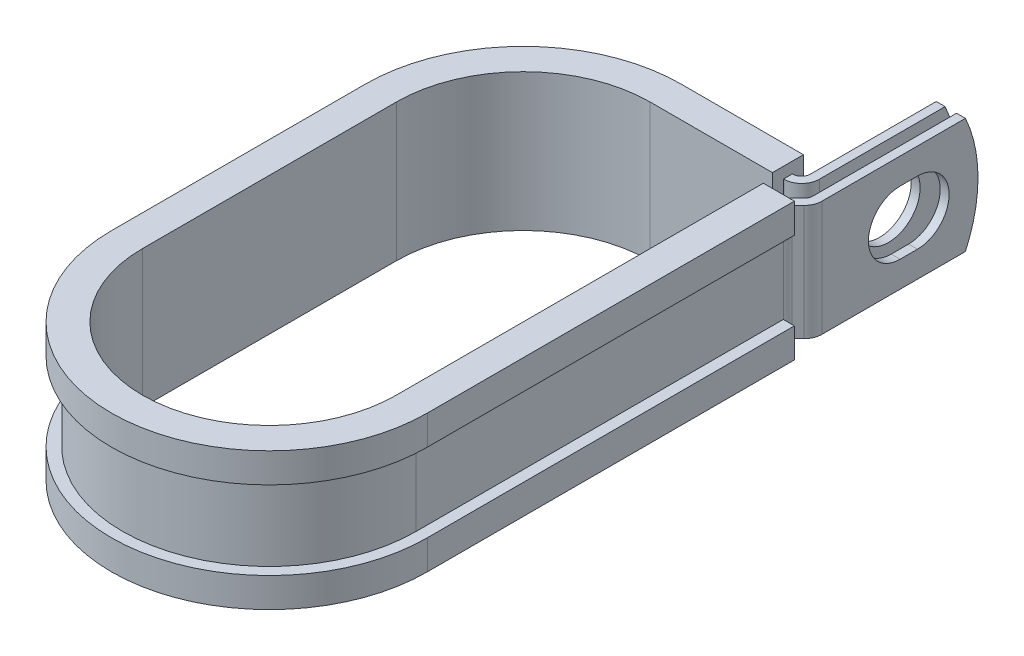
ISO-10303-21;
HEADER;
FILE_DESCRIPTION(('STEP AP214'),'2;1');
FILE_NAME('part.step','',(''),(''),'','','');
FILE_SCHEMA(('AUTOMOTIVE_DESIGN { 1 0 10303 214 1 1 1 1 }'));
ENDSEC;
DATA;
#1=APPLICATION_CONTEXT('core data for automotive mechanical design processes');
#2=APPLICATION_PROTOCOL_DEFINITION('international standard','automotive_design',2000,#1);
#3=PRODUCT_CONTEXT('',#1,'mechanical');
#4=PRODUCT('Part','Part','',(#3));
#5=PRODUCT_RELATED_PRODUCT_CATEGORY('part','',(#4));
#6=PRODUCT_DEFINITION_FORMATION('','',#4);
#7=PRODUCT_DEFINITION_CONTEXT('part definition',#1,'design');
#8=PRODUCT_DEFINITION('design','',#6,#7);
#9=PRODUCT_DEFINITION_SHAPE('','',#8);
#10=(LENGTH_UNIT() NAMED_UNIT(*) SI_UNIT(.MILLI.,.METRE.));
#11=(NAMED_UNIT(*) PLANE_ANGLE_UNIT() SI_UNIT($,.RADIAN.));
#12=(NAMED_UNIT(*) SI_UNIT($,.STERADIAN.) SOLID_ANGLE_UNIT());
#13=UNCERTAINTY_MEASURE_WITH_UNIT(LENGTH_MEASURE(1.E-05),#10,'distance_accuracy_value','');
#14=(GEOMETRIC_REPRESENTATION_CONTEXT(3) GLOBAL_UNCERTAINTY_ASSIGNED_CONTEXT((#13)) GLOBAL_UNIT_ASSIGNED_CONTEXT((#10,
#11,#12)) REPRESENTATION_CONTEXT('',''));
#15=CARTESIAN_POINT('',(0.,0.,0.));
#16=DIRECTION('',(0.,0.,1.));
#17=DIRECTION('',(1.,0.,0.));
#18=AXIS2_PLACEMENT_3D('',#15,#16,#17);
#19=CARTESIAN_POINT('',(19.6647698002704,-7.9375,-18.9865));
#20=DIRECTION('',(0.,1.,0.));
#21=DIRECTION('',(1.,0.,0.));
#22=AXIS2_PLACEMENT_3D('',#19,#20,#21);
#23=PLANE('',#22);
#24=DIRECTION('',(0.,0.,-1.));
#25=VECTOR('',#24,1.);
#26=CARTESIAN_POINT('',(16.8199698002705,-7.9375,-18.9865));
#27=LINE('',#26,#25);
#28=CARTESIAN_POINT('',(16.8199698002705,-7.9375,-18.9865));
#29=VERTEX_POINT('',#28);
#30=CARTESIAN_POINT('',(16.8199698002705,-7.9375,-20.2057));
#31=VERTEX_POINT('',#30);
#32=EDGE_CURVE('E582',#29,#31,#27,.T.);
#33=ORIENTED_EDGE('',*,*,#32,.T.);
#34=DIRECTION('',(1.,0.,0.));
#35=VECTOR('',#34,1.);
#36=CARTESIAN_POINT('',(0.,-7.9375,-20.2057));
#37=LINE('',#36,#35);
#38=CARTESIAN_POINT('',(16.8707698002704,-7.9375,-20.2057));
#39=VERTEX_POINT('',#38);
#40=EDGE_CURVE('E416',#39,#31,#37,.F.);
#41=ORIENTED_EDGE('',*,*,#40,.F.);
#42=CARTESIAN_POINT('',(16.8707698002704,-7.9375,-21.4249));
#43=DIRECTION('',(0.,1.,0.));
#44=DIRECTION('',(1.,0.,0.));
#45=AXIS2_PLACEMENT_3D('',#42,#43,#44);
#46=CIRCLE('',#45,1.2192);
#47=CARTESIAN_POINT('',(18.0899698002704,-7.9375,-21.4249));
#48=VERTEX_POINT('',#47);
#49=EDGE_CURVE('E414',#48,#39,#46,.F.);
#50=ORIENTED_EDGE('',*,*,#49,.F.);
#51=DIRECTION('',(0.,0.,1.));
#52=VECTOR('',#51,1.);
#53=CARTESIAN_POINT('',(18.0899698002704,-7.9375,-40.4622));
#54=LINE('',#53,#52);
#55=CARTESIAN_POINT('',(18.0899698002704,-7.9375,-38.7297804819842));
#56=VERTEX_POINT('',#55);
#57=EDGE_CURVE('E412',#56,#48,#54,.T.);
#58=ORIENTED_EDGE('',*,*,#57,.F.);
#59=DIRECTION('',(-1.,0.,0.));
#60=VECTOR('',#59,1.);
#61=CARTESIAN_POINT('',(22.1031698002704,-7.9375,-38.7297804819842));
#62=LINE('',#61,#60);
#63=CARTESIAN_POINT('',(19.3091698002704,-7.9375,-38.7297804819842));
#64=VERTEX_POINT('',#63);
#65=EDGE_CURVE('E12',#64,#56,#62,.T.);
#66=ORIENTED_EDGE('',*,*,#65,.F.);
#67=DIRECTION('',(0.,0.,1.));
#68=VECTOR('',#67,1.);
#69=CARTESIAN_POINT('',(19.3091698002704,-7.9375,-40.4622));
#70=LINE('',#69,#68);
#71=CARTESIAN_POINT('',(19.3091698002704,-7.9375,-21.4249));
#72=VERTEX_POINT('',#71);
#73=EDGE_CURVE('E410',#64,#72,#70,.T.);
#74=ORIENTED_EDGE('',*,*,#73,.T.);
#75=CARTESIAN_POINT('',(16.8707698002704,-7.9375,-21.4249));
#76=DIRECTION('',(0.,-1.,0.));
#77=DIRECTION('',(0.,0.,1.));
#78=AXIS2_PLACEMENT_3D('',#75,#76,#77);
#79=CIRCLE('',#78,2.4384);
#80=CARTESIAN_POINT('',(16.8707698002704,-7.9375,-18.9865));
#81=VERTEX_POINT('',#80);
#82=EDGE_CURVE('E407',#72,#81,#79,.T.);
#83=ORIENTED_EDGE('',*,*,#82,.T.);
#84=DIRECTION('',(-1.,0.,0.));
#85=VECTOR('',#84,1.);
#86=CARTESIAN_POINT('',(0.,-7.9375,-18.9865));
#87=LINE('',#86,#85);
#88=EDGE_CURVE('E404',#81,#29,#87,.T.);
#89=ORIENTED_EDGE('',*,*,#88,.T.);
#90=EDGE_LOOP('',(#33,#41,#50,#58,#66,#74,#83,#89));
#91=FACE_BOUND('',#90,.T.);
#92=ADVANCED_FACE('F55',(#91),#23,.F.);
#93=CARTESIAN_POINT('',(19.6647698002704,7.9375,-18.9865));
#94=DIRECTION('',(0.,1.,0.));
#95=DIRECTION('',(1.,0.,0.));
#96=AXIS2_PLACEMENT_3D('',#93,#94,#95);
#97=PLANE('',#96);
#98=DIRECTION('',(1.,0.,0.));
#99=VECTOR('',#98,1.);
#100=CARTESIAN_POINT('',(0.,7.9375,-20.2057));
#101=LINE('',#100,#99);
#102=CARTESIAN_POINT('',(16.8707698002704,7.9375,-20.2057));
#103=VERTEX_POINT('',#102);
#104=CARTESIAN_POINT('',(16.8199698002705,7.9375,-20.2057));
#105=VERTEX_POINT('',#104);
#106=EDGE_CURVE('E377',#103,#105,#101,.F.);
#107=ORIENTED_EDGE('',*,*,#106,.T.);
#108=DIRECTION('',(0.,0.,1.));
#109=VECTOR('',#108,1.);
#110=CARTESIAN_POINT('',(16.8199698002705,7.9375,-20.2057));
#111=LINE('',#110,#109);
#112=CARTESIAN_POINT('',(16.8199698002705,7.9375,-18.9865));
#113=VERTEX_POINT('',#112);
#114=EDGE_CURVE('E588',#105,#113,#111,.T.);
#115=ORIENTED_EDGE('',*,*,#114,.T.);
#116=DIRECTION('',(-1.,0.,0.));
#117=VECTOR('',#116,1.);
#118=CARTESIAN_POINT('',(0.,7.9375,-18.9865));
#119=LINE('',#118,#117);
#120=CARTESIAN_POINT('',(16.8707698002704,7.9375,-18.9865));
#121=VERTEX_POINT('',#120);
#122=EDGE_CURVE('E479',#121,#113,#119,.T.);
#123=ORIENTED_EDGE('',*,*,#122,.F.);
#124=CARTESIAN_POINT('',(16.8707698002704,7.9375,-21.4249));
#125=DIRECTION('',(0.,-1.,0.));
#126=DIRECTION('',(0.,0.,1.));
#127=AXIS2_PLACEMENT_3D('',#124,#125,#126);
#128=CIRCLE('',#127,2.4384);
#129=CARTESIAN_POINT('',(19.3091698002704,7.9375,-21.4249));
#130=VERTEX_POINT('',#129);
#131=EDGE_CURVE('E474',#130,#121,#128,.T.);
#132=ORIENTED_EDGE('',*,*,#131,.F.);
#133=DIRECTION('',(0.,0.,1.));
#134=VECTOR('',#133,1.);
#135=CARTESIAN_POINT('',(19.3091698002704,7.9375,-40.4622));
#136=LINE('',#135,#134);
#137=CARTESIAN_POINT('',(19.3091698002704,7.9375,-38.7297804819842));
#138=VERTEX_POINT('',#137);
#139=EDGE_CURVE('E468',#138,#130,#136,.T.);
#140=ORIENTED_EDGE('',*,*,#139,.F.);
#141=DIRECTION('',(-1.,0.,0.));
#142=VECTOR('',#141,1.);
#143=CARTESIAN_POINT('',(22.1031698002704,7.9375,-38.7297804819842));
#144=LINE('',#143,#142);
#145=CARTESIAN_POINT('',(18.0899698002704,7.9375,-38.7297804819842));
#146=VERTEX_POINT('',#145);
#147=EDGE_CURVE('E63',#138,#146,#144,.T.);
#148=ORIENTED_EDGE('',*,*,#147,.T.);
#149=DIRECTION('',(0.,0.,1.));
#150=VECTOR('',#149,1.);
#151=CARTESIAN_POINT('',(18.0899698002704,7.9375,-40.4622));
#152=LINE('',#151,#150);
#153=CARTESIAN_POINT('',(18.0899698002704,7.9375,-21.4249));
#154=VERTEX_POINT('',#153);
#155=EDGE_CURVE('E465',#146,#154,#152,.T.);
#156=ORIENTED_EDGE('',*,*,#155,.T.);
#157=CARTESIAN_POINT('',(16.8707698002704,7.9375,-21.4249));
#158=DIRECTION('',(0.,1.,0.));
#159=DIRECTION('',(1.,0.,0.));
#160=AXIS2_PLACEMENT_3D('',#157,#158,#159);
#161=CIRCLE('',#160,1.2192);
#162=EDGE_CURVE('E382',#154,#103,#161,.F.);
#163=ORIENTED_EDGE('',*,*,#162,.T.);
#164=EDGE_LOOP('',(#107,#115,#123,#132,#140,#148,#156,#163));
#165=FACE_BOUND('',#164,.T.);
#166=ADVANCED_FACE('F464',(#165),#97,.T.);
#167=CARTESIAN_POINT('',(0.,7.9375,-18.9865));
#168=DIRECTION('',(0.,0.,1.));
#169=DIRECTION('',(1.,0.,0.));
#170=AXIS2_PLACEMENT_3D('',#167,#168,#169);
#171=PLANE('',#170);
#172=ORIENTED_EDGE('',*,*,#122,.T.);
#173=DIRECTION('',(0.,-1.,0.));
#174=VECTOR('',#173,1.);
#175=CARTESIAN_POINT('',(16.8199698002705,7.9375,-18.9865));
#176=LINE('',#175,#174);
#177=EDGE_CURVE('E585',#113,#29,#176,.T.);
#178=ORIENTED_EDGE('',*,*,#177,.T.);
#179=ORIENTED_EDGE('',*,*,#88,.F.);
#180=DIRECTION('',(0.,-1.,0.));
#181=VECTOR('',#180,1.);
#182=CARTESIAN_POINT('',(16.8707698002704,7.9375,-18.9865));
#183=LINE('',#182,#181);
#184=EDGE_CURVE('E452',#121,#81,#183,.T.);
#185=ORIENTED_EDGE('',*,*,#184,.F.);
#186=EDGE_LOOP('',(#172,#178,#179,#185));
#187=FACE_BOUND('',#186,.T.);
#188=ADVANCED_FACE('F789',(#187),#171,.T.);
#189=CARTESIAN_POINT('',(22.1031698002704,7.9375,-18.9865));
#190=DIRECTION('',(-1.,0.,0.));
#191=DIRECTION('',(0.,0.,1.));
#192=AXIS2_PLACEMENT_3D('',#189,#190,#191);
#193=PLANE('',#192);
#194=CARTESIAN_POINT('',(22.1031698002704,0.,-32.1309999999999));
#195=DIRECTION('',(1.,0.,0.));
#196=DIRECTION('',(0.,0.,-1.));
#197=AXIS2_PLACEMENT_3D('',#194,#195,#196);
#198=CIRCLE('',#197,4.3561);
#199=CARTESIAN_POINT('',(22.1031698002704,-4.3561,-32.1310000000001));
#200=VERTEX_POINT('',#199);
#201=CARTESIAN_POINT('',(22.1031698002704,4.3561,-32.1310000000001));
#202=VERTEX_POINT('',#201);
#203=EDGE_CURVE('E527',#200,#202,#198,.T.);
#204=ORIENTED_EDGE('',*,*,#203,.F.);
#205=DIRECTION('',(0.,0.,-1.));
#206=VECTOR('',#205,1.);
#207=CARTESIAN_POINT('',(22.1031698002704,-4.3561,-29.7433999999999));
#208=LINE('',#207,#206);
#209=CARTESIAN_POINT('',(22.1031698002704,-4.3561,-29.7433999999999));
#210=VERTEX_POINT('',#209);
#211=EDGE_CURVE('E524',#210,#200,#208,.T.);
#212=ORIENTED_EDGE('',*,*,#211,.F.);
#213=CARTESIAN_POINT('',(22.1031698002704,0.,-29.7433999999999));
#214=DIRECTION('',(1.,0.,0.));
#215=DIRECTION('',(0.,0.,-1.));
#216=AXIS2_PLACEMENT_3D('',#213,#214,#215);
#217=CIRCLE('',#216,4.3561);
#218=CARTESIAN_POINT('',(22.1031698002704,4.3561,-29.7433999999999));
#219=VERTEX_POINT('',#218);
#220=EDGE_CURVE('E521',#219,#210,#217,.T.);
#221=ORIENTED_EDGE('',*,*,#220,.F.);
#222=DIRECTION('',(0.,0.,1.));
#223=VECTOR('',#222,1.);
#224=CARTESIAN_POINT('',(22.1031698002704,4.3561,-29.7433999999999));
#225=LINE('',#224,#223);
#226=EDGE_CURVE('E520',#202,#219,#225,.T.);
#227=ORIENTED_EDGE('',*,*,#226,.F.);
#228=EDGE_LOOP('',(#204,#212,#221,#227));
#229=FACE_BOUND('',#228,.T.);
#230=DIRECTION('',(0.,0.,-1.));
#231=VECTOR('',#230,1.);
#232=CARTESIAN_POINT('',(22.1031698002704,-7.9375,-18.9865));
#233=LINE('',#232,#231);
#234=CARTESIAN_POINT('',(22.1031698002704,-7.9375,-18.9865));
#235=VERTEX_POINT('',#234);
#236=CARTESIAN_POINT('',(22.1031698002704,-7.9375,-38.7297804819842));
#237=VERTEX_POINT('',#236);
#238=EDGE_CURVE('E388',#235,#237,#233,.T.);
#239=ORIENTED_EDGE('',*,*,#238,.T.);
#240=CARTESIAN_POINT('',(22.1031698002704,0.,-21.4122));
#241=DIRECTION('',(-1.,0.,0.));
#242=DIRECTION('',(0.,0.,1.));
#243=AXIS2_PLACEMENT_3D('',#240,#241,#242);
#244=CIRCLE('',#243,19.05);
#245=CARTESIAN_POINT('',(22.1031698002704,7.9375,-38.7297804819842));
#246=VERTEX_POINT('',#245);
#247=EDGE_CURVE('E536',#246,#237,#244,.T.);
#248=ORIENTED_EDGE('',*,*,#247,.F.);
#249=DIRECTION('',(0.,0.,-1.));
#250=VECTOR('',#249,1.);
#251=CARTESIAN_POINT('',(22.1031698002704,7.9375,-18.9865));
#252=LINE('',#251,#250);
#253=CARTESIAN_POINT('',(22.1031698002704,7.9375,-18.9865));
#254=VERTEX_POINT('',#253);
#255=EDGE_CURVE('E425',#254,#246,#252,.T.);
#256=ORIENTED_EDGE('',*,*,#255,.F.);
#257=DIRECTION('',(0.,-1.,0.));
#258=VECTOR('',#257,1.);
#259=CARTESIAN_POINT('',(22.1031698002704,7.9375,-18.9865));
#260=LINE('',#259,#258);
#261=EDGE_CURVE('E387',#254,#235,#260,.T.);
#262=ORIENTED_EDGE('',*,*,#261,.T.);
#263=EDGE_LOOP('',(#239,#248,#256,#262));
#264=FACE_BOUND('',#263,.T.);
#265=ADVANCED_FACE('F57',(#229,#264),#193,.F.);
#266=CARTESIAN_POINT('',(20.8839698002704,7.9375,-18.9865));
#267=DIRECTION('',(-1.,0.,0.));
#268=DIRECTION('',(0.,0.,1.));
#269=AXIS2_PLACEMENT_3D('',#266,#267,#268);
#270=PLANE('',#269);
#271=DIRECTION('',(0.,0.,-1.));
#272=VECTOR('',#271,1.);
#273=CARTESIAN_POINT('',(20.8839698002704,-4.3561,-29.7433999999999));
#274=LINE('',#273,#272);
#275=CARTESIAN_POINT('',(20.8839698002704,-4.3561,-29.7433999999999));
#276=VERTEX_POINT('',#275);
#277=CARTESIAN_POINT('',(20.8839698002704,-4.3561,-32.1310000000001));
#278=VERTEX_POINT('',#277);
#279=EDGE_CURVE('E505',#276,#278,#274,.T.);
#280=ORIENTED_EDGE('',*,*,#279,.T.);
#281=CARTESIAN_POINT('',(20.8839698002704,0.,-32.1309999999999));
#282=DIRECTION('',(-1.,0.,0.));
#283=DIRECTION('',(0.,0.,1.));
#284=AXIS2_PLACEMENT_3D('',#281,#282,#283);
#285=CIRCLE('',#284,4.3561);
#286=CARTESIAN_POINT('',(20.8839698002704,4.3561,-32.1310000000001));
#287=VERTEX_POINT('',#286);
#288=EDGE_CURVE('E504',#278,#287,#285,.F.);
#289=ORIENTED_EDGE('',*,*,#288,.T.);
#290=DIRECTION('',(0.,0.,1.));
#291=VECTOR('',#290,1.);
#292=CARTESIAN_POINT('',(20.8839698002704,4.3561,-29.7433999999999));
#293=LINE('',#292,#291);
#294=CARTESIAN_POINT('',(20.8839698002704,4.3561,-29.7433999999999));
#295=VERTEX_POINT('',#294);
#296=EDGE_CURVE('E508',#287,#295,#293,.T.);
#297=ORIENTED_EDGE('',*,*,#296,.T.);
#298=CARTESIAN_POINT('',(20.8839698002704,0.,-29.7433999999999));
#299=DIRECTION('',(-1.,0.,0.));
#300=DIRECTION('',(0.,0.,1.));
#301=AXIS2_PLACEMENT_3D('',#298,#299,#300);
#302=CIRCLE('',#301,4.3561);
#303=EDGE_CURVE('E501',#295,#276,#302,.F.);
#304=ORIENTED_EDGE('',*,*,#303,.T.);
#305=EDGE_LOOP('',(#280,#289,#297,#304));
#306=FACE_BOUND('',#305,.T.);
#307=CARTESIAN_POINT('',(20.8839698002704,0.,-21.4122));
#308=DIRECTION('',(-1.,0.,0.));
#309=DIRECTION('',(0.,0.,1.));
#310=AXIS2_PLACEMENT_3D('',#307,#308,#309);
#311=CIRCLE('',#310,19.05);
#312=CARTESIAN_POINT('',(20.8839698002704,7.9375,-38.7297804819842));
#313=VERTEX_POINT('',#312);
#314=CARTESIAN_POINT('',(20.8839698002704,-7.9375,-38.7297804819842));
#315=VERTEX_POINT('',#314);
#316=EDGE_CURVE('E77',#313,#315,#311,.T.);
#317=ORIENTED_EDGE('',*,*,#316,.T.);
#318=DIRECTION('',(0.,0.,-1.));
#319=VECTOR('',#318,1.);
#320=CARTESIAN_POINT('',(20.8839698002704,-7.9375,-18.9865));
#321=LINE('',#320,#319);
#322=CARTESIAN_POINT('',(20.8839698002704,-7.9375,-18.9865));
#323=VERTEX_POINT('',#322);
#324=EDGE_CURVE('E391',#323,#315,#321,.T.);
#325=ORIENTED_EDGE('',*,*,#324,.F.);
#326=DIRECTION('',(0.,-1.,0.));
#327=VECTOR('',#326,1.);
#328=CARTESIAN_POINT('',(20.8839698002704,7.9375,-18.9865));
#329=LINE('',#328,#327);
#330=CARTESIAN_POINT('',(20.8839698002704,7.9375,-18.9865));
#331=VERTEX_POINT('',#330);
#332=EDGE_CURVE('E460',#331,#323,#329,.T.);
#333=ORIENTED_EDGE('',*,*,#332,.F.);
#334=DIRECTION('',(0.,0.,-1.));
#335=VECTOR('',#334,1.);
#336=CARTESIAN_POINT('',(20.8839698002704,7.9375,-18.9865));
#337=LINE('',#336,#335);
#338=EDGE_CURVE('E489',#331,#313,#337,.T.);
#339=ORIENTED_EDGE('',*,*,#338,.T.);
#340=EDGE_LOOP('',(#317,#325,#333,#339));
#341=FACE_BOUND('',#340,.T.);
#342=ADVANCED_FACE('F762',(#306,#341),#270,.T.);
#343=CARTESIAN_POINT('',(19.3091698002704,7.9375,-40.4622));
#344=DIRECTION('',(1.,0.,0.));
#345=DIRECTION('',(0.,0.,-1.));
#346=AXIS2_PLACEMENT_3D('',#343,#344,#345);
#347=PLANE('',#346);
#348=CARTESIAN_POINT('',(19.3091698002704,0.,-30.9372));
#349=DIRECTION('',(1.,0.,0.));
#350=DIRECTION('',(0.,0.,-1.));
#351=AXIS2_PLACEMENT_3D('',#348,#349,#350);
#352=CIRCLE('',#351,4.3561);
#353=CARTESIAN_POINT('',(19.3091698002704,0.,-35.2933));
#354=VERTEX_POINT('',#353);
#355=EDGE_CURVE('E392',#354,#354,#352,.F.);
#356=ORIENTED_EDGE('',*,*,#355,.T.);
#357=EDGE_LOOP('',(#356));
#358=FACE_BOUND('',#357,.T.);
#359=ORIENTED_EDGE('',*,*,#73,.F.);
#360=CARTESIAN_POINT('',(19.3091698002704,0.,-21.4122));
#361=DIRECTION('',(1.,0.,0.));
#362=DIRECTION('',(0.,0.,-1.));
#363=AXIS2_PLACEMENT_3D('',#360,#361,#362);
#364=CIRCLE('',#363,19.05);
#365=EDGE_CURVE('E532',#64,#138,#364,.T.);
#366=ORIENTED_EDGE('',*,*,#365,.T.);
#367=ORIENTED_EDGE('',*,*,#139,.T.);
#368=DIRECTION('',(0.,-1.,0.));
#369=VECTOR('',#368,1.);
#370=CARTESIAN_POINT('',(19.3091698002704,7.9375,-21.4249));
#371=LINE('',#370,#369);
#372=EDGE_CURVE('E449',#130,#72,#371,.T.);
#373=ORIENTED_EDGE('',*,*,#372,.T.);
#374=EDGE_LOOP('',(#359,#366,#367,#373));
#375=FACE_BOUND('',#374,.T.);
#376=ADVANCED_FACE('F797',(#358,#375),#347,.T.);
#377=CARTESIAN_POINT('',(18.0899698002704,7.9375,-40.4622));
#378=DIRECTION('',(1.,0.,0.));
#379=DIRECTION('',(0.,0.,-1.));
#380=AXIS2_PLACEMENT_3D('',#377,#378,#379);
#381=PLANE('',#380);
#382=CARTESIAN_POINT('',(18.0899698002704,0.,-30.9372));
#383=DIRECTION('',(-1.,0.,0.));
#384=DIRECTION('',(0.,0.,1.));
#385=AXIS2_PLACEMENT_3D('',#382,#383,#384);
#386=CIRCLE('',#385,4.3561);
#387=CARTESIAN_POINT('',(18.0899698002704,0.,-26.5811));
#388=VERTEX_POINT('',#387);
#389=EDGE_CURVE('E496',#388,#388,#386,.T.);
#390=ORIENTED_EDGE('',*,*,#389,.F.);
#391=EDGE_LOOP('',(#390));
#392=FACE_BOUND('',#391,.T.);
#393=CARTESIAN_POINT('',(18.0899698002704,0.,-21.4122));
#394=DIRECTION('',(-1.,0.,0.));
#395=DIRECTION('',(0.,0.,1.));
#396=AXIS2_PLACEMENT_3D('',#393,#394,#395);
#397=CIRCLE('',#396,19.05);
#398=EDGE_CURVE('E69',#146,#56,#397,.T.);
#399=ORIENTED_EDGE('',*,*,#398,.T.);
#400=ORIENTED_EDGE('',*,*,#57,.T.);
#401=DIRECTION('',(0.,-1.,0.));
#402=VECTOR('',#401,1.);
#403=CARTESIAN_POINT('',(18.0899698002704,7.9375,-21.4249));
#404=LINE('',#403,#402);
#405=EDGE_CURVE('E446',#154,#48,#404,.T.);
#406=ORIENTED_EDGE('',*,*,#405,.F.);
#407=ORIENTED_EDGE('',*,*,#155,.F.);
#408=EDGE_LOOP('',(#399,#400,#406,#407));
#409=FACE_BOUND('',#408,.T.);
#410=ADVANCED_FACE('F471',(#392,#409),#381,.F.);
#411=CARTESIAN_POINT('',(21.4249,-7.9375,-15.5740026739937));
#412=DIRECTION('',(0.,1.,0.));
#413=DIRECTION('',(1.,0.,0.));
#414=AXIS2_PLACEMENT_3D('',#411,#412,#413);
#415=CIRCLE('',#414,1.2192);
#416=CARTESIAN_POINT('',(20.2057,-7.9375,-15.5740026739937));
#417=VERTEX_POINT('',#416);
#418=CARTESIAN_POINT('',(20.5627954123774,-7.9375,-16.4361072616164));
#419=VERTEX_POINT('',#418);
#420=EDGE_CURVE('E419',#417,#419,#415,.F.);
#421=ORIENTED_EDGE('',*,*,#420,.F.);
#422=DIRECTION('',(1.,0.,0.));
#423=VECTOR('',#422,1.);
#424=CARTESIAN_POINT('',(18.9865,-7.9375,-15.5740026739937));
#425=LINE('',#424,#423);
#426=CARTESIAN_POINT('',(18.9865,-7.9375,-15.5740026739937));
#427=VERTEX_POINT('',#426);
#428=EDGE_CURVE('E370',#427,#417,#425,.T.);
#429=ORIENTED_EDGE('',*,*,#428,.F.);
#430=CARTESIAN_POINT('',(21.4249,-7.9375,-15.5740026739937));
#431=DIRECTION('',(0.,-1.,0.));
#432=DIRECTION('',(0.,0.,1.));
#433=AXIS2_PLACEMENT_3D('',#430,#431,#432);
#434=CIRCLE('',#433,2.4384);
#435=CARTESIAN_POINT('',(19.7006908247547,-7.9375,-17.298211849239));
#436=VERTEX_POINT('',#435);
#437=EDGE_CURVE('E401',#427,#436,#434,.T.);
#438=ORIENTED_EDGE('',*,*,#437,.T.);
#439=DIRECTION('',(0.707106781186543,0.,-0.707106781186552));
#440=VECTOR('',#439,1.);
#441=CARTESIAN_POINT('',(19.7006908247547,-7.9375,-17.298211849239));
#442=LINE('',#441,#440);
#443=CARTESIAN_POINT('',(20.5268743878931,-7.9375,-18.1243954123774));
#444=VERTEX_POINT('',#443);
#445=EDGE_CURVE('E398',#436,#444,#442,.T.);
#446=ORIENTED_EDGE('',*,*,#445,.T.);
#447=CARTESIAN_POINT('',(19.6647698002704,-7.9375,-18.9865));
#448=DIRECTION('',(0.,1.,0.));
#449=DIRECTION('',(0.,0.,1.));
#450=AXIS2_PLACEMENT_3D('',#447,#448,#449);
#451=CIRCLE('',#450,1.2192);
#452=EDGE_CURVE('E395',#444,#323,#451,.T.);
#453=ORIENTED_EDGE('',*,*,#452,.T.);
#454=ORIENTED_EDGE('',*,*,#324,.T.);
#455=DIRECTION('',(-1.,0.,0.));
#456=VECTOR('',#455,1.);
#457=CARTESIAN_POINT('',(22.1031698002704,-7.9375,-38.7297804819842));
#458=LINE('',#457,#456);
#459=EDGE_CURVE('E538',#237,#315,#458,.T.);
#460=ORIENTED_EDGE('',*,*,#459,.F.);
#461=ORIENTED_EDGE('',*,*,#238,.F.);
#462=CARTESIAN_POINT('',(19.6647698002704,-7.9375,-18.9865));
#463=DIRECTION('',(0.,1.,0.));
#464=DIRECTION('',(1.,0.,0.));
#465=AXIS2_PLACEMENT_3D('',#462,#463,#464);
#466=CIRCLE('',#465,2.4384);
#467=CARTESIAN_POINT('',(21.3889789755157,-7.9375,-17.2622908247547));
#468=VERTEX_POINT('',#467);
#469=EDGE_CURVE('E423',#468,#235,#466,.T.);
#470=ORIENTED_EDGE('',*,*,#469,.F.);
#471=DIRECTION('',(0.707106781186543,0.,-0.707106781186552));
#472=VECTOR('',#471,1.);
#473=CARTESIAN_POINT('',(20.5627954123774,-7.9375,-16.4361072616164));
#474=LINE('',#473,#472);
#475=EDGE_CURVE('E421',#419,#468,#474,.T.);
#476=ORIENTED_EDGE('',*,*,#475,.F.);
#477=EDGE_LOOP('',(#421,#429,#438,#446,#453,#454,#460,#461,#470,#476));
#478=FACE_BOUND('',#477,.T.);
#479=ADVANCED_FACE('F743',(#478),#23,.F.);
#480=DIRECTION('',(-1.,0.,0.));
#481=VECTOR('',#480,1.);
#482=CARTESIAN_POINT('',(20.2057,7.9375,-15.5740026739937));
#483=LINE('',#482,#481);
#484=CARTESIAN_POINT('',(20.2057,7.9375,-15.5740026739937));
#485=VERTEX_POINT('',#484);
#486=CARTESIAN_POINT('',(18.9865,7.9375,-15.5740026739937));
#487=VERTEX_POINT('',#486);
#488=EDGE_CURVE('E350',#485,#487,#483,.T.);
#489=ORIENTED_EDGE('',*,*,#488,.F.);
#490=CARTESIAN_POINT('',(21.4249,7.9375,-15.5740026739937));
#491=DIRECTION('',(0.,1.,0.));
#492=DIRECTION('',(1.,0.,0.));
#493=AXIS2_PLACEMENT_3D('',#490,#491,#492);
#494=CIRCLE('',#493,1.2192);
#495=CARTESIAN_POINT('',(20.5627954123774,7.9375,-16.4361072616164));
#496=VERTEX_POINT('',#495);
#497=EDGE_CURVE('E365',#485,#496,#494,.F.);
#498=ORIENTED_EDGE('',*,*,#497,.T.);
#499=DIRECTION('',(0.707106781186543,0.,-0.707106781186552));
#500=VECTOR('',#499,1.);
#501=CARTESIAN_POINT('',(20.5627954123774,7.9375,-16.4361072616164));
#502=LINE('',#501,#500);
#503=CARTESIAN_POINT('',(21.3889789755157,7.9375,-17.2622908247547));
#504=VERTEX_POINT('',#503);
#505=EDGE_CURVE('E376',#496,#504,#502,.T.);
#506=ORIENTED_EDGE('',*,*,#505,.T.);
#507=CARTESIAN_POINT('',(19.6647698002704,7.9375,-18.9865));
#508=DIRECTION('',(0.,1.,0.));
#509=DIRECTION('',(1.,0.,0.));
#510=AXIS2_PLACEMENT_3D('',#507,#508,#509);
#511=CIRCLE('',#510,2.4384);
#512=EDGE_CURVE('E379',#504,#254,#511,.T.);
#513=ORIENTED_EDGE('',*,*,#512,.T.);
#514=ORIENTED_EDGE('',*,*,#255,.T.);
#515=DIRECTION('',(-1.,0.,0.));
#516=VECTOR('',#515,1.);
#517=CARTESIAN_POINT('',(22.1031698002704,7.9375,-38.7297804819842));
#518=LINE('',#517,#516);
#519=EDGE_CURVE('E534',#246,#313,#518,.T.);
#520=ORIENTED_EDGE('',*,*,#519,.T.);
#521=ORIENTED_EDGE('',*,*,#338,.F.);
#522=CARTESIAN_POINT('',(19.6647698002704,7.9375,-18.9865));
#523=DIRECTION('',(0.,1.,0.));
#524=DIRECTION('',(0.,0.,1.));
#525=AXIS2_PLACEMENT_3D('',#522,#523,#524);
#526=CIRCLE('',#525,1.2192);
#527=CARTESIAN_POINT('',(20.5268743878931,7.9375,-18.1243954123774));
#528=VERTEX_POINT('',#527);
#529=EDGE_CURVE('E486',#528,#331,#526,.T.);
#530=ORIENTED_EDGE('',*,*,#529,.F.);
#531=DIRECTION('',(0.707106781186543,0.,-0.707106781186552));
#532=VECTOR('',#531,1.);
#533=CARTESIAN_POINT('',(19.7006908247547,7.9375,-17.298211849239));
#534=LINE('',#533,#532);
#535=CARTESIAN_POINT('',(19.7006908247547,7.9375,-17.298211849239));
#536=VERTEX_POINT('',#535);
#537=EDGE_CURVE('E483',#536,#528,#534,.T.);
#538=ORIENTED_EDGE('',*,*,#537,.F.);
#539=CARTESIAN_POINT('',(21.4249,7.9375,-15.5740026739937));
#540=DIRECTION('',(0.,-1.,0.));
#541=DIRECTION('',(0.,0.,1.));
#542=AXIS2_PLACEMENT_3D('',#539,#540,#541);
#543=CIRCLE('',#542,2.4384);
#544=EDGE_CURVE('E369',#487,#536,#543,.T.);
#545=ORIENTED_EDGE('',*,*,#544,.F.);
#546=EDGE_LOOP('',(#489,#498,#506,#513,#514,#520,#521,#530,#538,#545));
#547=FACE_BOUND('',#546,.T.);
#548=ADVANCED_FACE('F364',(#547),#97,.T.);
#549=CARTESIAN_POINT('',(19.6647698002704,7.9375,-18.9865));
#550=DIRECTION('',(0.,-1.,0.));
#551=DIRECTION('',(0.,0.,-1.));
#552=AXIS2_PLACEMENT_3D('',#549,#550,#551);
#553=CYLINDRICAL_SURFACE('',#552,1.2192);
#554=ORIENTED_EDGE('',*,*,#452,.F.);
#555=DIRECTION('',(0.,-1.,0.));
#556=VECTOR('',#555,1.);
#557=CARTESIAN_POINT('',(20.5268743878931,7.9375,-18.1243954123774));
#558=LINE('',#557,#556);
#559=EDGE_CURVE('E458',#528,#444,#558,.T.);
#560=ORIENTED_EDGE('',*,*,#559,.F.);
#561=ORIENTED_EDGE('',*,*,#529,.T.);
#562=ORIENTED_EDGE('',*,*,#332,.T.);
#563=EDGE_LOOP('',(#554,#560,#561,#562));
#564=FACE_BOUND('',#563,.T.);
#565=ADVANCED_FACE('F765',(#564),#553,.F.);
#566=CARTESIAN_POINT('',(19.7006908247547,7.9375,-17.298211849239));
#567=DIRECTION('',(-0.707106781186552,0.,-0.707106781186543));
#568=DIRECTION('',(-0.707106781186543,0.,0.707106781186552));
#569=AXIS2_PLACEMENT_3D('',#566,#567,#568);
#570=PLANE('',#569);
#571=ORIENTED_EDGE('',*,*,#445,.F.);
#572=DIRECTION('',(0.,-1.,0.));
#573=VECTOR('',#572,1.);
#574=CARTESIAN_POINT('',(19.7006908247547,7.9375,-17.298211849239));
#575=LINE('',#574,#573);
#576=EDGE_CURVE('E456',#536,#436,#575,.T.);
#577=ORIENTED_EDGE('',*,*,#576,.F.);
#578=ORIENTED_EDGE('',*,*,#537,.T.);
#579=ORIENTED_EDGE('',*,*,#559,.T.);
#580=EDGE_LOOP('',(#571,#577,#578,#579));
#581=FACE_BOUND('',#580,.T.);
#582=ADVANCED_FACE('F768',(#581),#570,.T.);
#583=CARTESIAN_POINT('',(21.4249,7.9375,-15.5740026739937));
#584=DIRECTION('',(0.,-1.,0.));
#585=DIRECTION('',(0.,0.,-1.));
#586=AXIS2_PLACEMENT_3D('',#583,#584,#585);
#587=CYLINDRICAL_SURFACE('',#586,2.4384);
#588=ORIENTED_EDGE('',*,*,#437,.F.);
#589=DIRECTION('',(0.,-1.,0.));
#590=VECTOR('',#589,1.);
#591=CARTESIAN_POINT('',(18.9865,7.9375,-15.5740026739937));
#592=LINE('',#591,#590);
#593=EDGE_CURVE('E454',#487,#427,#592,.T.);
#594=ORIENTED_EDGE('',*,*,#593,.F.);
#595=ORIENTED_EDGE('',*,*,#544,.T.);
#596=ORIENTED_EDGE('',*,*,#576,.T.);
#597=EDGE_LOOP('',(#588,#594,#595,#596));
#598=FACE_BOUND('',#597,.T.);
#599=ADVANCED_FACE('F770',(#598),#587,.T.);
#600=CARTESIAN_POINT('',(16.8707698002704,7.9375,-21.4249));
#601=DIRECTION('',(0.,-1.,0.));
#602=DIRECTION('',(0.,0.,-1.));
#603=AXIS2_PLACEMENT_3D('',#600,#601,#602);
#604=CYLINDRICAL_SURFACE('',#603,2.4384);
#605=ORIENTED_EDGE('',*,*,#82,.F.);
#606=ORIENTED_EDGE('',*,*,#372,.F.);
#607=ORIENTED_EDGE('',*,*,#131,.T.);
#608=ORIENTED_EDGE('',*,*,#184,.T.);
#609=EDGE_LOOP('',(#605,#606,#607,#608));
#610=FACE_BOUND('',#609,.T.);
#611=ADVANCED_FACE('F772',(#610),#604,.T.);
#612=CARTESIAN_POINT('',(16.8707698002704,7.9375,-21.4249));
#613=DIRECTION('',(0.,-1.,0.));
#614=DIRECTION('',(0.,0.,-1.));
#615=AXIS2_PLACEMENT_3D('',#612,#613,#614);
#616=CYLINDRICAL_SURFACE('',#615,1.2192);
#617=ORIENTED_EDGE('',*,*,#49,.T.);
#618=DIRECTION('',(0.,-1.,0.));
#619=VECTOR('',#618,1.);
#620=CARTESIAN_POINT('',(16.8707698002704,7.9375,-20.2057));
#621=LINE('',#620,#619);
#622=EDGE_CURVE('E443',#103,#39,#621,.T.);
#623=ORIENTED_EDGE('',*,*,#622,.F.);
#624=ORIENTED_EDGE('',*,*,#162,.F.);
#625=ORIENTED_EDGE('',*,*,#405,.T.);
#626=EDGE_LOOP('',(#617,#623,#624,#625));
#627=FACE_BOUND('',#626,.T.);
#628=ADVANCED_FACE('F778',(#627),#616,.F.);
#629=CARTESIAN_POINT('',(0.,7.9375,-20.2057));
#630=DIRECTION('',(0.,0.,1.));
#631=DIRECTION('',(1.,0.,0.));
#632=AXIS2_PLACEMENT_3D('',#629,#630,#631);
#633=PLANE('',#632);
#634=DIRECTION('',(0.,-1.,0.));
#635=VECTOR('',#634,1.);
#636=CARTESIAN_POINT('',(0.,7.9375,-20.2057));
#637=LINE('',#636,#635);
#638=CARTESIAN_POINT('',(0.,5.3975,-20.2057));
#639=VERTEX_POINT('',#638);
#640=CARTESIAN_POINT('',(0.,-5.3975,-20.2057));
#641=VERTEX_POINT('',#640);
#642=EDGE_CURVE('E440',#639,#641,#637,.T.);
#643=ORIENTED_EDGE('',*,*,#642,.F.);
#644=DIRECTION('',(1.,0.,0.));
#645=VECTOR('',#644,1.);
#646=CARTESIAN_POINT('',(0.,5.3975,-20.2057));
#647=LINE('',#646,#645);
#648=CARTESIAN_POINT('',(16.8199698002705,5.3975,-20.2057));
#649=VERTEX_POINT('',#648);
#650=EDGE_CURVE('E541',#639,#649,#647,.T.);
#651=ORIENTED_EDGE('',*,*,#650,.T.);
#652=DIRECTION('',(0.,1.,0.));
#653=VECTOR('',#652,1.);
#654=CARTESIAN_POINT('',(16.8199698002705,7.9375,-20.2057));
#655=LINE('',#654,#653);
#656=EDGE_CURVE('E591',#649,#105,#655,.T.);
#657=ORIENTED_EDGE('',*,*,#656,.T.);
#658=ORIENTED_EDGE('',*,*,#106,.F.);
#659=ORIENTED_EDGE('',*,*,#622,.T.);
#660=ORIENTED_EDGE('',*,*,#40,.T.);
#661=DIRECTION('',(0.,1.,0.));
#662=VECTOR('',#661,1.);
#663=CARTESIAN_POINT('',(16.8199698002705,-7.9375,-20.2057));
#664=LINE('',#663,#662);
#665=CARTESIAN_POINT('',(16.8199698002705,-5.3975,-20.2057));
#666=VERTEX_POINT('',#665);
#667=EDGE_CURVE('E579',#31,#666,#664,.T.);
#668=ORIENTED_EDGE('',*,*,#667,.T.);
#669=DIRECTION('',(1.,0.,0.));
#670=VECTOR('',#669,1.);
#671=CARTESIAN_POINT('',(0.,-5.3975,-20.2057));
#672=LINE('',#671,#670);
#673=EDGE_CURVE('E562',#641,#666,#672,.T.);
#674=ORIENTED_EDGE('',*,*,#673,.F.);
#675=EDGE_LOOP('',(#643,#651,#657,#658,#659,#660,#668,#674));
#676=FACE_BOUND('',#675,.T.);
#677=ADVANCED_FACE('F830',(#676),#633,.F.);
#678=CARTESIAN_POINT('',(0.,7.9375,0.));
#679=DIRECTION('',(0.,-1.,0.));
#680=DIRECTION('',(0.,0.,-1.));
#681=AXIS2_PLACEMENT_3D('',#678,#679,#680);
#682=CYLINDRICAL_SURFACE('',#681,20.2057);
#683=DIRECTION('',(0.,-1.,0.));
#684=VECTOR('',#683,1.);
#685=CARTESIAN_POINT('',(-20.2057,7.9375,0.));
#686=LINE('',#685,#684);
#687=CARTESIAN_POINT('',(-20.2057,5.3975,0.));
#688=VERTEX_POINT('',#687);
#689=CARTESIAN_POINT('',(-20.2057,-5.3975,0.));
#690=VERTEX_POINT('',#689);
#691=EDGE_CURVE('E437',#688,#690,#686,.T.);
#692=ORIENTED_EDGE('',*,*,#691,.F.);
#693=CARTESIAN_POINT('',(0.,5.3975,0.));
#694=DIRECTION('',(0.,-1.,0.));
#695=DIRECTION('',(0.,0.,-1.));
#696=AXIS2_PLACEMENT_3D('',#693,#694,#695);
#697=CIRCLE('',#696,20.2057);
#698=EDGE_CURVE('E594',#688,#639,#697,.T.);
#699=ORIENTED_EDGE('',*,*,#698,.T.);
#700=ORIENTED_EDGE('',*,*,#642,.T.);
#701=CARTESIAN_POINT('',(0.,-5.3975,0.));
#702=DIRECTION('',(0.,-1.,0.));
#703=DIRECTION('',(0.,0.,-1.));
#704=AXIS2_PLACEMENT_3D('',#701,#702,#703);
#705=CIRCLE('',#704,20.2057);
#706=EDGE_CURVE('E615',#690,#641,#705,.T.);
#707=ORIENTED_EDGE('',*,*,#706,.F.);
#708=EDGE_LOOP('',(#692,#699,#700,#707));
#709=FACE_BOUND('',#708,.T.);
#710=ADVANCED_FACE('F841',(#709),#682,.T.);
#711=CARTESIAN_POINT('',(-20.2057,7.9375,0.));
#712=DIRECTION('',(1.,0.,0.));
#713=DIRECTION('',(0.,0.,-1.));
#714=AXIS2_PLACEMENT_3D('',#711,#712,#713);
#715=PLANE('',#714);
#716=DIRECTION('',(0.,-1.,0.));
#717=VECTOR('',#716,1.);
#718=CARTESIAN_POINT('',(-20.2057,7.9375,34.925));
#719=LINE('',#718,#717);
#720=CARTESIAN_POINT('',(-20.2057,5.3975,34.925));
#721=VERTEX_POINT('',#720);
#722=CARTESIAN_POINT('',(-20.2057,-5.3975,34.925));
#723=VERTEX_POINT('',#722);
#724=EDGE_CURVE('E434',#721,#723,#719,.T.);
#725=ORIENTED_EDGE('',*,*,#724,.F.);
#726=DIRECTION('',(0.,0.,-1.));
#727=VECTOR('',#726,1.);
#728=CARTESIAN_POINT('',(-20.2057,5.3975,34.925));
#729=LINE('',#728,#727);
#730=EDGE_CURVE('E626',#721,#688,#729,.T.);
#731=ORIENTED_EDGE('',*,*,#730,.T.);
#732=ORIENTED_EDGE('',*,*,#691,.T.);
#733=DIRECTION('',(0.,0.,-1.));
#734=VECTOR('',#733,1.);
#735=CARTESIAN_POINT('',(-20.2057,-5.3975,34.925));
#736=LINE('',#735,#734);
#737=EDGE_CURVE('E647',#723,#690,#736,.T.);
#738=ORIENTED_EDGE('',*,*,#737,.F.);
#739=EDGE_LOOP('',(#725,#731,#732,#738));
#740=FACE_BOUND('',#739,.T.);
#741=ADVANCED_FACE('F846',(#740),#715,.F.);
#742=CARTESIAN_POINT('',(0.,7.9375,34.925));
#743=DIRECTION('',(0.,-1.,0.));
#744=DIRECTION('',(0.,0.,-1.));
#745=AXIS2_PLACEMENT_3D('',#742,#743,#744);
#746=CYLINDRICAL_SURFACE('',#745,20.2057);
#747=DIRECTION('',(0.,-1.,0.));
#748=VECTOR('',#747,1.);
#749=CARTESIAN_POINT('',(20.2057,7.9375,34.925));
#750=LINE('',#749,#748);
#751=CARTESIAN_POINT('',(20.2057,5.3975,34.925));
#752=VERTEX_POINT('',#751);
#753=CARTESIAN_POINT('',(20.2057,-5.3975,34.925));
#754=VERTEX_POINT('',#753);
#755=EDGE_CURVE('E359',#752,#754,#750,.T.);
#756=ORIENTED_EDGE('',*,*,#755,.F.);
#757=CARTESIAN_POINT('',(0.,5.3975,34.925));
#758=DIRECTION('',(0.,-1.,0.));
#759=DIRECTION('',(0.,0.,-1.));
#760=AXIS2_PLACEMENT_3D('',#757,#758,#759);
#761=CIRCLE('',#760,20.2057);
#762=EDGE_CURVE('E658',#752,#721,#761,.T.);
#763=ORIENTED_EDGE('',*,*,#762,.T.);
#764=ORIENTED_EDGE('',*,*,#724,.T.);
#765=CARTESIAN_POINT('',(0.,-5.3975,34.925));
#766=DIRECTION('',(0.,-1.,0.));
#767=DIRECTION('',(0.,0.,-1.));
#768=AXIS2_PLACEMENT_3D('',#765,#766,#767);
#769=CIRCLE('',#768,20.2057);
#770=EDGE_CURVE('E679',#754,#723,#769,.T.);
#771=ORIENTED_EDGE('',*,*,#770,.F.);
#772=EDGE_LOOP('',(#756,#763,#764,#771));
#773=FACE_BOUND('',#772,.T.);
#774=ADVANCED_FACE('F851',(#773),#746,.T.);
#775=CARTESIAN_POINT('',(20.2057,7.9375,0.));
#776=DIRECTION('',(-1.,0.,0.));
#777=DIRECTION('',(0.,0.,1.));
#778=AXIS2_PLACEMENT_3D('',#775,#776,#777);
#779=PLANE('',#778);
#780=DIRECTION('',(0.,-1.,0.));
#781=VECTOR('',#780,1.);
#782=CARTESIAN_POINT('',(20.2057,7.9375,-15.5740026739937));
#783=LINE('',#782,#781);
#784=CARTESIAN_POINT('',(20.2057,5.3975,-15.5740026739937));
#785=VERTEX_POINT('',#784);
#786=CARTESIAN_POINT('',(20.2057,-5.3975,-15.5740026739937));
#787=VERTEX_POINT('',#786);
#788=EDGE_CURVE('E360',#785,#787,#783,.T.);
#789=ORIENTED_EDGE('',*,*,#788,.F.);
#790=DIRECTION('',(0.,0.,-1.));
#791=VECTOR('',#790,1.);
#792=CARTESIAN_POINT('',(20.2057,5.3975,0.));
#793=LINE('',#792,#791);
#794=EDGE_CURVE('E699',#752,#785,#793,.T.);
#795=ORIENTED_EDGE('',*,*,#794,.F.);
#796=ORIENTED_EDGE('',*,*,#755,.T.);
#797=DIRECTION('',(0.,0.,-1.));
#798=VECTOR('',#797,1.);
#799=CARTESIAN_POINT('',(20.2057,-5.3975,0.));
#800=LINE('',#799,#798);
#801=EDGE_CURVE('E700',#754,#787,#800,.T.);
#802=ORIENTED_EDGE('',*,*,#801,.T.);
#803=EDGE_LOOP('',(#789,#795,#796,#802));
#804=FACE_BOUND('',#803,.T.);
#805=ADVANCED_FACE('F854',(#804),#779,.F.);
#806=CARTESIAN_POINT('',(21.4249,7.9375,-15.5740026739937));
#807=DIRECTION('',(0.,-1.,0.));
#808=DIRECTION('',(0.,0.,-1.));
#809=AXIS2_PLACEMENT_3D('',#806,#807,#808);
#810=CYLINDRICAL_SURFACE('',#809,1.2192);
#811=ORIENTED_EDGE('',*,*,#420,.T.);
#812=DIRECTION('',(0.,-1.,0.));
#813=VECTOR('',#812,1.);
#814=CARTESIAN_POINT('',(20.5627954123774,7.9375,-16.4361072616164));
#815=LINE('',#814,#813);
#816=EDGE_CURVE('E374',#496,#419,#815,.T.);
#817=ORIENTED_EDGE('',*,*,#816,.F.);
#818=ORIENTED_EDGE('',*,*,#497,.F.);
#819=EDGE_CURVE('E347',#485,#785,#783,.T.);
#820=ORIENTED_EDGE('',*,*,#819,.T.);
#821=ORIENTED_EDGE('',*,*,#788,.T.);
#822=DIRECTION('',(0.,1.,0.));
#823=VECTOR('',#822,1.);
#824=CARTESIAN_POINT('',(20.2057,-7.9375,-15.5740026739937));
#825=LINE('',#824,#823);
#826=EDGE_CURVE('E734',#417,#787,#825,.T.);
#827=ORIENTED_EDGE('',*,*,#826,.F.);
#828=EDGE_LOOP('',(#811,#817,#818,#820,#821,#827));
#829=FACE_BOUND('',#828,.T.);
#830=ADVANCED_FACE('F372',(#829),#810,.F.);
#831=CARTESIAN_POINT('',(20.5627954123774,7.9375,-16.4361072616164));
#832=DIRECTION('',(-0.707106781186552,0.,-0.707106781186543));
#833=DIRECTION('',(-0.707106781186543,0.,0.707106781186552));
#834=AXIS2_PLACEMENT_3D('',#831,#832,#833);
#835=PLANE('',#834);
#836=ORIENTED_EDGE('',*,*,#475,.T.);
#837=DIRECTION('',(0.,-1.,0.));
#838=VECTOR('',#837,1.);
#839=CARTESIAN_POINT('',(21.3889789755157,7.9375,-17.2622908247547));
#840=LINE('',#839,#838);
#841=EDGE_CURVE('E428',#504,#468,#840,.T.);
#842=ORIENTED_EDGE('',*,*,#841,.F.);
#843=ORIENTED_EDGE('',*,*,#505,.F.);
#844=ORIENTED_EDGE('',*,*,#816,.T.);
#845=EDGE_LOOP('',(#836,#842,#843,#844));
#846=FACE_BOUND('',#845,.T.);
#847=ADVANCED_FACE('F748',(#846),#835,.F.);
#848=CARTESIAN_POINT('',(19.6647698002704,7.9375,-18.9865));
#849=DIRECTION('',(0.,-1.,0.));
#850=DIRECTION('',(0.,0.,-1.));
#851=AXIS2_PLACEMENT_3D('',#848,#849,#850);
#852=CYLINDRICAL_SURFACE('',#851,2.4384);
#853=ORIENTED_EDGE('',*,*,#469,.T.);
#854=ORIENTED_EDGE('',*,*,#261,.F.);
#855=ORIENTED_EDGE('',*,*,#512,.F.);
#856=ORIENTED_EDGE('',*,*,#841,.T.);
#857=EDGE_LOOP('',(#853,#854,#855,#856));
#858=FACE_BOUND('',#857,.T.);
#859=ADVANCED_FACE('F751',(#858),#852,.T.);
#860=CARTESIAN_POINT('',(31.6300811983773,0.,-30.9372));
#861=DIRECTION('',(-1.,0.,0.));
#862=DIRECTION('',(0.,0.,1.));
#863=AXIS2_PLACEMENT_3D('',#860,#861,#862);
#864=CYLINDRICAL_SURFACE('',#863,4.3561);
#865=ORIENTED_EDGE('',*,*,#389,.T.);
#866=EDGE_LOOP('',(#865));
#867=FACE_BOUND('',#866,.T.);
#868=ORIENTED_EDGE('',*,*,#355,.F.);
#869=EDGE_LOOP('',(#868));
#870=FACE_BOUND('',#869,.T.);
#871=ADVANCED_FACE('F965',(#867,#870),#864,.F.);
#872=CARTESIAN_POINT('',(6.77340677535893,-4.3561,-29.7433999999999));
#873=DIRECTION('',(0.,-1.,0.));
#874=DIRECTION('',(0.,0.,-1.));
#875=AXIS2_PLACEMENT_3D('',#872,#873,#874);
#876=PLANE('',#875);
#877=DIRECTION('',(1.,0.,0.));
#878=VECTOR('',#877,1.);
#879=CARTESIAN_POINT('',(6.77340677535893,-4.3561,-29.7433999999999));
#880=LINE('',#879,#878);
#881=EDGE_CURVE('E499',#276,#210,#880,.T.);
#882=ORIENTED_EDGE('',*,*,#881,.T.);
#883=ORIENTED_EDGE('',*,*,#211,.T.);
#884=DIRECTION('',(1.,0.,0.));
#885=VECTOR('',#884,1.);
#886=CARTESIAN_POINT('',(6.77340677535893,-4.3561,-32.1310000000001));
#887=LINE('',#886,#885);
#888=EDGE_CURVE('E502',#278,#200,#887,.T.);
#889=ORIENTED_EDGE('',*,*,#888,.F.);
#890=ORIENTED_EDGE('',*,*,#279,.F.);
#891=EDGE_LOOP('',(#882,#883,#889,#890));
#892=FACE_BOUND('',#891,.T.);
#893=ADVANCED_FACE('F961',(#892),#876,.F.);
#894=CARTESIAN_POINT('',(6.77340677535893,0.,-32.1309999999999));
#895=DIRECTION('',(1.,0.,0.));
#896=DIRECTION('',(0.,0.,-1.));
#897=AXIS2_PLACEMENT_3D('',#894,#895,#896);
#898=CYLINDRICAL_SURFACE('',#897,4.3561);
#899=ORIENTED_EDGE('',*,*,#888,.T.);
#900=ORIENTED_EDGE('',*,*,#203,.T.);
#901=DIRECTION('',(1.,0.,0.));
#902=VECTOR('',#901,1.);
#903=CARTESIAN_POINT('',(6.77340677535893,4.3561,-32.1310000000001));
#904=LINE('',#903,#902);
#905=EDGE_CURVE('E506',#287,#202,#904,.T.);
#906=ORIENTED_EDGE('',*,*,#905,.F.);
#907=ORIENTED_EDGE('',*,*,#288,.F.);
#908=EDGE_LOOP('',(#899,#900,#906,#907));
#909=FACE_BOUND('',#908,.T.);
#910=ADVANCED_FACE('F957',(#909),#898,.F.);
#911=CARTESIAN_POINT('',(6.77340677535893,4.3561,-29.7433999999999));
#912=DIRECTION('',(0.,1.,0.));
#913=DIRECTION('',(0.,0.,1.));
#914=AXIS2_PLACEMENT_3D('',#911,#912,#913);
#915=PLANE('',#914);
#916=ORIENTED_EDGE('',*,*,#905,.T.);
#917=ORIENTED_EDGE('',*,*,#226,.T.);
#918=DIRECTION('',(1.,0.,0.));
#919=VECTOR('',#918,1.);
#920=CARTESIAN_POINT('',(6.77340677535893,4.3561,-29.7433999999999));
#921=LINE('',#920,#919);
#922=EDGE_CURVE('E509',#295,#219,#921,.T.);
#923=ORIENTED_EDGE('',*,*,#922,.F.);
#924=ORIENTED_EDGE('',*,*,#296,.F.);
#925=EDGE_LOOP('',(#916,#917,#923,#924));
#926=FACE_BOUND('',#925,.T.);
#927=ADVANCED_FACE('F953',(#926),#915,.F.);
#928=CARTESIAN_POINT('',(6.77340677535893,0.,-29.7433999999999));
#929=DIRECTION('',(1.,0.,0.));
#930=DIRECTION('',(0.,0.,-1.));
#931=AXIS2_PLACEMENT_3D('',#928,#929,#930);
#932=CYLINDRICAL_SURFACE('',#931,4.3561);
#933=ORIENTED_EDGE('',*,*,#922,.T.);
#934=ORIENTED_EDGE('',*,*,#220,.T.);
#935=ORIENTED_EDGE('',*,*,#881,.F.);
#936=ORIENTED_EDGE('',*,*,#303,.F.);
#937=EDGE_LOOP('',(#933,#934,#935,#936));
#938=FACE_BOUND('',#937,.T.);
#939=ADVANCED_FACE('F950',(#938),#932,.F.);
#940=CARTESIAN_POINT('',(22.1031698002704,0.,-21.4122));
#941=DIRECTION('',(-1.,0.,0.));
#942=DIRECTION('',(0.,0.,1.));
#943=AXIS2_PLACEMENT_3D('',#940,#941,#942);
#944=CYLINDRICAL_SURFACE('',#943,19.05);
#945=ORIENTED_EDGE('',*,*,#365,.F.);
#946=ORIENTED_EDGE('',*,*,#65,.T.);
#947=ORIENTED_EDGE('',*,*,#398,.F.);
#948=ORIENTED_EDGE('',*,*,#147,.F.);
#949=EDGE_LOOP('',(#945,#946,#947,#948));
#950=FACE_BOUND('',#949,.T.);
#951=ADVANCED_FACE('F821',(#950),#944,.T.);
#952=ORIENTED_EDGE('',*,*,#519,.F.);
#953=ORIENTED_EDGE('',*,*,#247,.T.);
#954=ORIENTED_EDGE('',*,*,#459,.T.);
#955=ORIENTED_EDGE('',*,*,#316,.F.);
#956=EDGE_LOOP('',(#952,#953,#954,#955));
#957=FACE_BOUND('',#956,.T.);
#958=ADVANCED_FACE('F758',(#957),#944,.T.);
#959=CARTESIAN_POINT('',(0.,9.4615,-21.7297));
#960=DIRECTION('',(0.,0.,1.));
#961=DIRECTION('',(1.,0.,0.));
#962=AXIS2_PLACEMENT_3D('',#959,#960,#961);
#963=PLANE('',#962);
#964=DIRECTION('',(0.,-1.,0.));
#965=VECTOR('',#964,1.);
#966=CARTESIAN_POINT('',(0.,9.4615,-21.7297));
#967=LINE('',#966,#965);
#968=CARTESIAN_POINT('',(0.,9.4615,-21.7297));
#969=VERTEX_POINT('',#968);
#970=CARTESIAN_POINT('',(0.,5.3975,-21.7297));
#971=VERTEX_POINT('',#970);
#972=EDGE_CURVE('E617',#969,#971,#967,.T.);
#973=ORIENTED_EDGE('',*,*,#972,.F.);
#974=DIRECTION('',(1.,0.,0.));
#975=VECTOR('',#974,1.);
#976=CARTESIAN_POINT('',(0.,9.4615,-21.7297));
#977=LINE('',#976,#975);
#978=CARTESIAN_POINT('',(16.8199698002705,9.4615,-21.7297));
#979=VERTEX_POINT('',#978);
#980=EDGE_CURVE('E547',#969,#979,#977,.T.);
#981=ORIENTED_EDGE('',*,*,#980,.T.);
#982=DIRECTION('',(0.,-1.,0.));
#983=VECTOR('',#982,1.);
#984=CARTESIAN_POINT('',(16.8199698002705,9.4615,-21.7297));
#985=LINE('',#984,#983);
#986=CARTESIAN_POINT('',(16.8199698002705,5.3975,-21.7297));
#987=VERTEX_POINT('',#986);
#988=EDGE_CURVE('E567',#979,#987,#985,.T.);
#989=ORIENTED_EDGE('',*,*,#988,.T.);
#990=DIRECTION('',(1.,0.,0.));
#991=VECTOR('',#990,1.);
#992=CARTESIAN_POINT('',(0.,5.3975,-21.7297));
#993=LINE('',#992,#991);
#994=EDGE_CURVE('E544',#971,#987,#993,.T.);
#995=ORIENTED_EDGE('',*,*,#994,.F.);
#996=EDGE_LOOP('',(#973,#981,#989,#995));
#997=FACE_BOUND('',#996,.T.);
#998=ADVANCED_FACE('F890',(#997),#963,.F.);
#999=CARTESIAN_POINT('',(0.,9.4615,-17.4625));
#1000=DIRECTION('',(0.,0.,-1.));
#1001=DIRECTION('',(0.,1.,0.));
#1002=AXIS2_PLACEMENT_3D('',#999,#1000,#1001);
#1003=PLANE('',#1002);
#1004=DIRECTION('',(0.,1.,0.));
#1005=VECTOR('',#1004,1.);
#1006=CARTESIAN_POINT('',(0.,9.4615,-17.4625));
#1007=LINE('',#1006,#1005);
#1008=CARTESIAN_POINT('',(0.,-9.4615,-17.4625));
#1009=VERTEX_POINT('',#1008);
#1010=CARTESIAN_POINT('',(0.,9.4615,-17.4625));
#1011=VERTEX_POINT('',#1010);
#1012=EDGE_CURVE('E620',#1009,#1011,#1007,.T.);
#1013=ORIENTED_EDGE('',*,*,#1012,.F.);
#1014=DIRECTION('',(1.,0.,0.));
#1015=VECTOR('',#1014,1.);
#1016=CARTESIAN_POINT('',(0.,-9.4615,-17.4625));
#1017=LINE('',#1016,#1015);
#1018=CARTESIAN_POINT('',(16.8199698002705,-9.4615,-17.4625));
#1019=VERTEX_POINT('',#1018);
#1020=EDGE_CURVE('E553',#1009,#1019,#1017,.T.);
#1021=ORIENTED_EDGE('',*,*,#1020,.T.);
#1022=DIRECTION('',(0.,1.,0.));
#1023=VECTOR('',#1022,1.);
#1024=CARTESIAN_POINT('',(16.8199698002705,9.4615,-17.4625));
#1025=LINE('',#1024,#1023);
#1026=CARTESIAN_POINT('',(16.8199698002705,9.4615,-17.4625));
#1027=VERTEX_POINT('',#1026);
#1028=EDGE_CURVE('E571',#1019,#1027,#1025,.T.);
#1029=ORIENTED_EDGE('',*,*,#1028,.T.);
#1030=DIRECTION('',(1.,0.,0.));
#1031=VECTOR('',#1030,1.);
#1032=CARTESIAN_POINT('',(0.,9.4615,-17.4625));
#1033=LINE('',#1032,#1031);
#1034=EDGE_CURVE('E550',#1011,#1027,#1033,.T.);
#1035=ORIENTED_EDGE('',*,*,#1034,.F.);
#1036=EDGE_LOOP('',(#1013,#1021,#1029,#1035));
#1037=FACE_BOUND('',#1036,.T.);
#1038=ADVANCED_FACE('F896',(#1037),#1003,.F.);
#1039=CARTESIAN_POINT('',(0.,-9.4615,-21.7297));
#1040=DIRECTION('',(0.,0.,1.));
#1041=DIRECTION('',(1.,0.,0.));
#1042=AXIS2_PLACEMENT_3D('',#1039,#1040,#1041);
#1043=PLANE('',#1042);
#1044=DIRECTION('',(0.,-1.,0.));
#1045=VECTOR('',#1044,1.);
#1046=CARTESIAN_POINT('',(0.,-9.4615,-21.7297));
#1047=LINE('',#1046,#1045);
#1048=CARTESIAN_POINT('',(0.,-5.3975,-21.7297));
#1049=VERTEX_POINT('',#1048);
#1050=CARTESIAN_POINT('',(0.,-9.4615,-21.7297));
#1051=VERTEX_POINT('',#1050);
#1052=EDGE_CURVE('E623',#1049,#1051,#1047,.T.);
#1053=ORIENTED_EDGE('',*,*,#1052,.F.);
#1054=DIRECTION('',(1.,0.,0.));
#1055=VECTOR('',#1054,1.);
#1056=CARTESIAN_POINT('',(0.,-5.3975,-21.7297));
#1057=LINE('',#1056,#1055);
#1058=CARTESIAN_POINT('',(16.8199698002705,-5.3975,-21.7297));
#1059=VERTEX_POINT('',#1058);
#1060=EDGE_CURVE('E559',#1049,#1059,#1057,.T.);
#1061=ORIENTED_EDGE('',*,*,#1060,.T.);
#1062=DIRECTION('',(0.,-1.,0.));
#1063=VECTOR('',#1062,1.);
#1064=CARTESIAN_POINT('',(16.8199698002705,-9.4615,-21.7297));
#1065=LINE('',#1064,#1063);
#1066=CARTESIAN_POINT('',(16.8199698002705,-9.4615,-21.7297));
#1067=VERTEX_POINT('',#1066);
#1068=EDGE_CURVE('E575',#1059,#1067,#1065,.T.);
#1069=ORIENTED_EDGE('',*,*,#1068,.T.);
#1070=DIRECTION('',(1.,0.,0.));
#1071=VECTOR('',#1070,1.);
#1072=CARTESIAN_POINT('',(0.,-9.4615,-21.7297));
#1073=LINE('',#1072,#1071);
#1074=EDGE_CURVE('E556',#1051,#1067,#1073,.T.);
#1075=ORIENTED_EDGE('',*,*,#1074,.F.);
#1076=EDGE_LOOP('',(#1053,#1061,#1069,#1075));
#1077=FACE_BOUND('',#1076,.T.);
#1078=ADVANCED_FACE('F904',(#1077),#1043,.F.);
#1079=CARTESIAN_POINT('',(0.,7.9375,0.));
#1080=DIRECTION('',(0.,-1.,0.));
#1081=DIRECTION('',(0.,0.,-1.));
#1082=AXIS2_PLACEMENT_3D('',#1079,#1080,#1081);
#1083=CYLINDRICAL_SURFACE('',#1082,21.7297);
#1084=DIRECTION('',(0.,-1.,0.));
#1085=VECTOR('',#1084,1.);
#1086=CARTESIAN_POINT('',(-21.7297,9.4615,0.));
#1087=LINE('',#1086,#1085);
#1088=CARTESIAN_POINT('',(-21.7297,9.4615,0.));
#1089=VERTEX_POINT('',#1088);
#1090=CARTESIAN_POINT('',(-21.7297,5.3975,0.));
#1091=VERTEX_POINT('',#1090);
#1092=EDGE_CURVE('E649',#1089,#1091,#1087,.T.);
#1093=ORIENTED_EDGE('',*,*,#1092,.F.);
#1094=CARTESIAN_POINT('',(0.,9.4615,0.));
#1095=DIRECTION('',(0.,-1.,0.));
#1096=DIRECTION('',(0.,0.,-1.));
#1097=AXIS2_PLACEMENT_3D('',#1094,#1095,#1096);
#1098=CIRCLE('',#1097,21.7297);
#1099=EDGE_CURVE('E600',#1089,#969,#1098,.T.);
#1100=ORIENTED_EDGE('',*,*,#1099,.T.);
#1101=ORIENTED_EDGE('',*,*,#972,.T.);
#1102=CARTESIAN_POINT('',(0.,5.3975,0.));
#1103=DIRECTION('',(0.,-1.,0.));
#1104=DIRECTION('',(0.,0.,-1.));
#1105=AXIS2_PLACEMENT_3D('',#1102,#1103,#1104);
#1106=CIRCLE('',#1105,21.7297);
#1107=EDGE_CURVE('E597',#1091,#971,#1106,.T.);
#1108=ORIENTED_EDGE('',*,*,#1107,.F.);
#1109=EDGE_LOOP('',(#1093,#1100,#1101,#1108));
#1110=FACE_BOUND('',#1109,.T.);
#1111=ADVANCED_FACE('F887',(#1110),#1083,.T.);
#1112=CARTESIAN_POINT('',(0.,7.9375,0.));
#1113=DIRECTION('',(0.,-1.,0.));
#1114=DIRECTION('',(0.,0.,-1.));
#1115=AXIS2_PLACEMENT_3D('',#1112,#1113,#1114);
#1116=CYLINDRICAL_SURFACE('',#1115,17.4625);
#1117=DIRECTION('',(0.,1.,0.));
#1118=VECTOR('',#1117,1.);
#1119=CARTESIAN_POINT('',(-17.4625,9.4615,0.));
#1120=LINE('',#1119,#1118);
#1121=CARTESIAN_POINT('',(-17.4625,-9.4615,0.));
#1122=VERTEX_POINT('',#1121);
#1123=CARTESIAN_POINT('',(-17.4625,9.4615,0.));
#1124=VERTEX_POINT('',#1123);
#1125=EDGE_CURVE('E652',#1122,#1124,#1120,.T.);
#1126=ORIENTED_EDGE('',*,*,#1125,.F.);
#1127=CARTESIAN_POINT('',(0.,-9.4615,0.));
#1128=DIRECTION('',(0.,-1.,0.));
#1129=DIRECTION('',(0.,0.,-1.));
#1130=AXIS2_PLACEMENT_3D('',#1127,#1128,#1129);
#1131=CIRCLE('',#1130,17.4625);
#1132=EDGE_CURVE('E606',#1122,#1009,#1131,.T.);
#1133=ORIENTED_EDGE('',*,*,#1132,.T.);
#1134=ORIENTED_EDGE('',*,*,#1012,.T.);
#1135=CARTESIAN_POINT('',(0.,9.4615,0.));
#1136=DIRECTION('',(0.,-1.,0.));
#1137=DIRECTION('',(0.,0.,-1.));
#1138=AXIS2_PLACEMENT_3D('',#1135,#1136,#1137);
#1139=CIRCLE('',#1138,17.4625);
#1140=EDGE_CURVE('E603',#1124,#1011,#1139,.T.);
#1141=ORIENTED_EDGE('',*,*,#1140,.F.);
#1142=EDGE_LOOP('',(#1126,#1133,#1134,#1141));
#1143=FACE_BOUND('',#1142,.T.);
#1144=ADVANCED_FACE('F899',(#1143),#1116,.F.);
#1145=CARTESIAN_POINT('',(0.,7.9375,0.));
#1146=DIRECTION('',(0.,-1.,0.));
#1147=DIRECTION('',(0.,0.,-1.));
#1148=AXIS2_PLACEMENT_3D('',#1145,#1146,#1147);
#1149=CYLINDRICAL_SURFACE('',#1148,21.7297);
#1150=DIRECTION('',(0.,-1.,0.));
#1151=VECTOR('',#1150,1.);
#1152=CARTESIAN_POINT('',(-21.7297,-9.4615,0.));
#1153=LINE('',#1152,#1151);
#1154=CARTESIAN_POINT('',(-21.7297,-5.3975,0.));
#1155=VERTEX_POINT('',#1154);
#1156=CARTESIAN_POINT('',(-21.7297,-9.4615,0.));
#1157=VERTEX_POINT('',#1156);
#1158=EDGE_CURVE('E655',#1155,#1157,#1153,.T.);
#1159=ORIENTED_EDGE('',*,*,#1158,.F.);
#1160=CARTESIAN_POINT('',(0.,-5.3975,0.));
#1161=DIRECTION('',(0.,-1.,0.));
#1162=DIRECTION('',(0.,0.,-1.));
#1163=AXIS2_PLACEMENT_3D('',#1160,#1161,#1162);
#1164=CIRCLE('',#1163,21.7297);
#1165=EDGE_CURVE('E612',#1155,#1049,#1164,.T.);
#1166=ORIENTED_EDGE('',*,*,#1165,.T.);
#1167=ORIENTED_EDGE('',*,*,#1052,.T.);
#1168=CARTESIAN_POINT('',(0.,-9.4615,0.));
#1169=DIRECTION('',(0.,-1.,0.));
#1170=DIRECTION('',(0.,0.,-1.));
#1171=AXIS2_PLACEMENT_3D('',#1168,#1169,#1170);
#1172=CIRCLE('',#1171,21.7297);
#1173=EDGE_CURVE('E609',#1157,#1051,#1172,.T.);
#1174=ORIENTED_EDGE('',*,*,#1173,.F.);
#1175=EDGE_LOOP('',(#1159,#1166,#1167,#1174));
#1176=FACE_BOUND('',#1175,.T.);
#1177=ADVANCED_FACE('F908',(#1176),#1149,.T.);
#1178=CARTESIAN_POINT('',(-21.7297,9.4615,34.925));
#1179=DIRECTION('',(1.,0.,0.));
#1180=DIRECTION('',(0.,0.,-1.));
#1181=AXIS2_PLACEMENT_3D('',#1178,#1179,#1180);
#1182=PLANE('',#1181);
#1183=DIRECTION('',(0.,-1.,0.));
#1184=VECTOR('',#1183,1.);
#1185=CARTESIAN_POINT('',(-21.7297,9.4615,34.925));
#1186=LINE('',#1185,#1184);
#1187=CARTESIAN_POINT('',(-21.7297,9.4615,34.925));
#1188=VERTEX_POINT('',#1187);
#1189=CARTESIAN_POINT('',(-21.7297,5.3975,34.925));
#1190=VERTEX_POINT('',#1189);
#1191=EDGE_CURVE('E681',#1188,#1190,#1186,.T.);
#1192=ORIENTED_EDGE('',*,*,#1191,.F.);
#1193=DIRECTION('',(0.,0.,-1.));
#1194=VECTOR('',#1193,1.);
#1195=CARTESIAN_POINT('',(-21.7297,9.4615,34.925));
#1196=LINE('',#1195,#1194);
#1197=EDGE_CURVE('E632',#1188,#1089,#1196,.T.);
#1198=ORIENTED_EDGE('',*,*,#1197,.T.);
#1199=ORIENTED_EDGE('',*,*,#1092,.T.);
#1200=DIRECTION('',(0.,0.,-1.));
#1201=VECTOR('',#1200,1.);
#1202=CARTESIAN_POINT('',(-21.7297,5.3975,34.925));
#1203=LINE('',#1202,#1201);
#1204=EDGE_CURVE('E629',#1190,#1091,#1203,.T.);
#1205=ORIENTED_EDGE('',*,*,#1204,.F.);
#1206=EDGE_LOOP('',(#1192,#1198,#1199,#1205));
#1207=FACE_BOUND('',#1206,.T.);
#1208=ADVANCED_FACE('F884',(#1207),#1182,.F.);
#1209=CARTESIAN_POINT('',(-17.4625,9.4615,34.925));
#1210=DIRECTION('',(-1.,0.,0.));
#1211=DIRECTION('',(0.,-1.,0.));
#1212=AXIS2_PLACEMENT_3D('',#1209,#1210,#1211);
#1213=PLANE('',#1212);
#1214=DIRECTION('',(0.,1.,0.));
#1215=VECTOR('',#1214,1.);
#1216=CARTESIAN_POINT('',(-17.4625,9.4615,34.925));
#1217=LINE('',#1216,#1215);
#1218=CARTESIAN_POINT('',(-17.4625,-9.4615,34.925));
#1219=VERTEX_POINT('',#1218);
#1220=CARTESIAN_POINT('',(-17.4625,9.4615,34.925));
#1221=VERTEX_POINT('',#1220);
#1222=EDGE_CURVE('E684',#1219,#1221,#1217,.T.);
#1223=ORIENTED_EDGE('',*,*,#1222,.F.);
#1224=DIRECTION('',(0.,0.,-1.));
#1225=VECTOR('',#1224,1.);
#1226=CARTESIAN_POINT('',(-17.4625,-9.4615,34.925));
#1227=LINE('',#1226,#1225);
#1228=EDGE_CURVE('E638',#1219,#1122,#1227,.T.);
#1229=ORIENTED_EDGE('',*,*,#1228,.T.);
#1230=ORIENTED_EDGE('',*,*,#1125,.T.);
#1231=DIRECTION('',(0.,0.,-1.));
#1232=VECTOR('',#1231,1.);
#1233=CARTESIAN_POINT('',(-17.4625,9.4615,34.925));
#1234=LINE('',#1233,#1232);
#1235=EDGE_CURVE('E635',#1221,#1124,#1234,.T.);
#1236=ORIENTED_EDGE('',*,*,#1235,.F.);
#1237=EDGE_LOOP('',(#1223,#1229,#1230,#1236));
#1238=FACE_BOUND('',#1237,.T.);
#1239=ADVANCED_FACE('F930',(#1238),#1213,.F.);
#1240=CARTESIAN_POINT('',(-21.7297,-9.4615,34.925));
#1241=DIRECTION('',(1.,0.,0.));
#1242=DIRECTION('',(0.,0.,-1.));
#1243=AXIS2_PLACEMENT_3D('',#1240,#1241,#1242);
#1244=PLANE('',#1243);
#1245=DIRECTION('',(0.,-1.,0.));
#1246=VECTOR('',#1245,1.);
#1247=CARTESIAN_POINT('',(-21.7297,-9.4615,34.925));
#1248=LINE('',#1247,#1246);
#1249=CARTESIAN_POINT('',(-21.7297,-5.3975,34.925));
#1250=VERTEX_POINT('',#1249);
#1251=CARTESIAN_POINT('',(-21.7297,-9.4615,34.925));
#1252=VERTEX_POINT('',#1251);
#1253=EDGE_CURVE('E687',#1250,#1252,#1248,.T.);
#1254=ORIENTED_EDGE('',*,*,#1253,.F.);
#1255=DIRECTION('',(0.,0.,-1.));
#1256=VECTOR('',#1255,1.);
#1257=CARTESIAN_POINT('',(-21.7297,-5.3975,34.925));
#1258=LINE('',#1257,#1256);
#1259=EDGE_CURVE('E644',#1250,#1155,#1258,.T.);
#1260=ORIENTED_EDGE('',*,*,#1259,.T.);
#1261=ORIENTED_EDGE('',*,*,#1158,.T.);
#1262=DIRECTION('',(0.,0.,-1.));
#1263=VECTOR('',#1262,1.);
#1264=CARTESIAN_POINT('',(-21.7297,-9.4615,34.925));
#1265=LINE('',#1264,#1263);
#1266=EDGE_CURVE('E641',#1252,#1157,#1265,.T.);
#1267=ORIENTED_EDGE('',*,*,#1266,.F.);
#1268=EDGE_LOOP('',(#1254,#1260,#1261,#1267));
#1269=FACE_BOUND('',#1268,.T.);
#1270=ADVANCED_FACE('F910',(#1269),#1244,.F.);
#1271=CARTESIAN_POINT('',(0.,7.9375,34.925));
#1272=DIRECTION('',(0.,-1.,0.));
#1273=DIRECTION('',(0.,0.,-1.));
#1274=AXIS2_PLACEMENT_3D('',#1271,#1272,#1273);
#1275=CYLINDRICAL_SURFACE('',#1274,21.7297);
#1276=DIRECTION('',(0.,-1.,0.));
#1277=VECTOR('',#1276,1.);
#1278=CARTESIAN_POINT('',(21.7297,9.4615,34.925));
#1279=LINE('',#1278,#1277);
#1280=CARTESIAN_POINT('',(21.7297,9.4615,34.925));
#1281=VERTEX_POINT('',#1280);
#1282=CARTESIAN_POINT('',(21.7297,5.3975,34.925));
#1283=VERTEX_POINT('',#1282);
#1284=EDGE_CURVE('E690',#1281,#1283,#1279,.T.);
#1285=ORIENTED_EDGE('',*,*,#1284,.F.);
#1286=CARTESIAN_POINT('',(0.,9.4615,34.925));
#1287=DIRECTION('',(0.,-1.,0.));
#1288=DIRECTION('',(0.,0.,-1.));
#1289=AXIS2_PLACEMENT_3D('',#1286,#1287,#1288);
#1290=CIRCLE('',#1289,21.7297);
#1291=EDGE_CURVE('E664',#1281,#1188,#1290,.T.);
#1292=ORIENTED_EDGE('',*,*,#1291,.T.);
#1293=ORIENTED_EDGE('',*,*,#1191,.T.);
#1294=CARTESIAN_POINT('',(0.,5.3975,34.925));
#1295=DIRECTION('',(0.,-1.,0.));
#1296=DIRECTION('',(0.,0.,-1.));
#1297=AXIS2_PLACEMENT_3D('',#1294,#1295,#1296);
#1298=CIRCLE('',#1297,21.7297);
#1299=EDGE_CURVE('E661',#1283,#1190,#1298,.T.);
#1300=ORIENTED_EDGE('',*,*,#1299,.F.);
#1301=EDGE_LOOP('',(#1285,#1292,#1293,#1300));
#1302=FACE_BOUND('',#1301,.T.);
#1303=ADVANCED_FACE('F881',(#1302),#1275,.T.);
#1304=CARTESIAN_POINT('',(0.,7.9375,34.925));
#1305=DIRECTION('',(0.,-1.,0.));
#1306=DIRECTION('',(0.,0.,-1.));
#1307=AXIS2_PLACEMENT_3D('',#1304,#1305,#1306);
#1308=CYLINDRICAL_SURFACE('',#1307,17.4625);
#1309=DIRECTION('',(0.,1.,0.));
#1310=VECTOR('',#1309,1.);
#1311=CARTESIAN_POINT('',(17.4625,9.4615,34.925));
#1312=LINE('',#1311,#1310);
#1313=CARTESIAN_POINT('',(17.4625,-9.4615,34.925));
#1314=VERTEX_POINT('',#1313);
#1315=CARTESIAN_POINT('',(17.4625,9.4615,34.925));
#1316=VERTEX_POINT('',#1315);
#1317=EDGE_CURVE('E693',#1314,#1316,#1312,.T.);
#1318=ORIENTED_EDGE('',*,*,#1317,.F.);
#1319=CARTESIAN_POINT('',(0.,-9.4615,34.925));
#1320=DIRECTION('',(0.,-1.,0.));
#1321=DIRECTION('',(0.,0.,-1.));
#1322=AXIS2_PLACEMENT_3D('',#1319,#1320,#1321);
#1323=CIRCLE('',#1322,17.4625);
#1324=EDGE_CURVE('E670',#1314,#1219,#1323,.T.);
#1325=ORIENTED_EDGE('',*,*,#1324,.T.);
#1326=ORIENTED_EDGE('',*,*,#1222,.T.);
#1327=CARTESIAN_POINT('',(0.,9.4615,34.925));
#1328=DIRECTION('',(0.,-1.,0.));
#1329=DIRECTION('',(0.,0.,-1.));
#1330=AXIS2_PLACEMENT_3D('',#1327,#1328,#1329);
#1331=CIRCLE('',#1330,17.4625);
#1332=EDGE_CURVE('E667',#1316,#1221,#1331,.T.);
#1333=ORIENTED_EDGE('',*,*,#1332,.F.);
#1334=EDGE_LOOP('',(#1318,#1325,#1326,#1333));
#1335=FACE_BOUND('',#1334,.T.);
#1336=ADVANCED_FACE('F914',(#1335),#1308,.F.);
#1337=CARTESIAN_POINT('',(0.,7.9375,34.925));
#1338=DIRECTION('',(0.,-1.,0.));
#1339=DIRECTION('',(0.,0.,-1.));
#1340=AXIS2_PLACEMENT_3D('',#1337,#1338,#1339);
#1341=CYLINDRICAL_SURFACE('',#1340,21.7297);
#1342=DIRECTION('',(0.,-1.,0.));
#1343=VECTOR('',#1342,1.);
#1344=CARTESIAN_POINT('',(21.7297,-9.4615,34.925));
#1345=LINE('',#1344,#1343);
#1346=CARTESIAN_POINT('',(21.7297,-5.3975,34.925));
#1347=VERTEX_POINT('',#1346);
#1348=CARTESIAN_POINT('',(21.7297,-9.4615,34.925));
#1349=VERTEX_POINT('',#1348);
#1350=EDGE_CURVE('E696',#1347,#1349,#1345,.T.);
#1351=ORIENTED_EDGE('',*,*,#1350,.F.);
#1352=CARTESIAN_POINT('',(0.,-5.3975,34.925));
#1353=DIRECTION('',(0.,-1.,0.));
#1354=DIRECTION('',(0.,0.,-1.));
#1355=AXIS2_PLACEMENT_3D('',#1352,#1353,#1354);
#1356=CIRCLE('',#1355,21.7297);
#1357=EDGE_CURVE('E676',#1347,#1250,#1356,.T.);
#1358=ORIENTED_EDGE('',*,*,#1357,.T.);
#1359=ORIENTED_EDGE('',*,*,#1253,.T.);
#1360=CARTESIAN_POINT('',(0.,-9.4615,34.925));
#1361=DIRECTION('',(0.,-1.,0.));
#1362=DIRECTION('',(0.,0.,-1.));
#1363=AXIS2_PLACEMENT_3D('',#1360,#1361,#1362);
#1364=CIRCLE('',#1363,21.7297);
#1365=EDGE_CURVE('E673',#1349,#1252,#1364,.T.);
#1366=ORIENTED_EDGE('',*,*,#1365,.F.);
#1367=EDGE_LOOP('',(#1351,#1358,#1359,#1366));
#1368=FACE_BOUND('',#1367,.T.);
#1369=ADVANCED_FACE('F912',(#1368),#1341,.T.);
#1370=CARTESIAN_POINT('',(21.7297,5.3975,0.));
#1371=DIRECTION('',(0.,-1.,0.));
#1372=DIRECTION('',(0.,0.,-1.));
#1373=AXIS2_PLACEMENT_3D('',#1370,#1371,#1372);
#1374=PLANE('',#1373);
#1375=DIRECTION('',(-1.,0.,0.));
#1376=VECTOR('',#1375,1.);
#1377=CARTESIAN_POINT('',(21.7297,5.3975,-15.5740026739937));
#1378=LINE('',#1377,#1376);
#1379=CARTESIAN_POINT('',(21.7297,5.3975,-15.5740026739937));
#1380=VERTEX_POINT('',#1379);
#1381=EDGE_CURVE('E354',#1380,#785,#1378,.T.);
#1382=ORIENTED_EDGE('',*,*,#1381,.F.);
#1383=DIRECTION('',(0.,0.,-1.));
#1384=VECTOR('',#1383,1.);
#1385=CARTESIAN_POINT('',(21.7297,5.3975,0.));
#1386=LINE('',#1385,#1384);
#1387=EDGE_CURVE('E713',#1283,#1380,#1386,.T.);
#1388=ORIENTED_EDGE('',*,*,#1387,.F.);
#1389=ORIENTED_EDGE('',*,*,#1299,.T.);
#1390=ORIENTED_EDGE('',*,*,#1204,.T.);
#1391=ORIENTED_EDGE('',*,*,#1107,.T.);
#1392=ORIENTED_EDGE('',*,*,#994,.T.);
#1393=DIRECTION('',(0.,0.,1.));
#1394=VECTOR('',#1393,1.);
#1395=CARTESIAN_POINT('',(16.8199698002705,5.3975,-21.7297));
#1396=LINE('',#1395,#1394);
#1397=EDGE_CURVE('E565',#987,#649,#1396,.T.);
#1398=ORIENTED_EDGE('',*,*,#1397,.T.);
#1399=ORIENTED_EDGE('',*,*,#650,.F.);
#1400=ORIENTED_EDGE('',*,*,#698,.F.);
#1401=ORIENTED_EDGE('',*,*,#730,.F.);
#1402=ORIENTED_EDGE('',*,*,#762,.F.);
#1403=ORIENTED_EDGE('',*,*,#794,.T.);
#1404=EDGE_LOOP('',(#1382,#1388,#1389,#1390,#1391,#1392,#1398,#1399,#1400,#1401,#1402,#1403));
#1405=FACE_BOUND('',#1404,.T.);
#1406=ADVANCED_FACE('F843',(#1405),#1374,.T.);
#1407=CARTESIAN_POINT('',(21.7297,9.4615,0.));
#1408=DIRECTION('',(1.,0.,0.));
#1409=DIRECTION('',(0.,0.,-1.));
#1410=AXIS2_PLACEMENT_3D('',#1407,#1408,#1409);
#1411=PLANE('',#1410);
#1412=DIRECTION('',(0.,-1.,0.));
#1413=VECTOR('',#1412,1.);
#1414=CARTESIAN_POINT('',(21.7297,9.4615,-15.5740026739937));
#1415=LINE('',#1414,#1413);
#1416=CARTESIAN_POINT('',(21.7297,9.4615,-15.5740026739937));
#1417=VERTEX_POINT('',#1416);
#1418=EDGE_CURVE('E717',#1417,#1380,#1415,.T.);
#1419=ORIENTED_EDGE('',*,*,#1418,.F.);
#1420=DIRECTION('',(0.,0.,-1.));
#1421=VECTOR('',#1420,1.);
#1422=CARTESIAN_POINT('',(21.7297,9.4615,0.));
#1423=LINE('',#1422,#1421);
#1424=EDGE_CURVE('E711',#1281,#1417,#1423,.T.);
#1425=ORIENTED_EDGE('',*,*,#1424,.F.);
#1426=ORIENTED_EDGE('',*,*,#1284,.T.);
#1427=ORIENTED_EDGE('',*,*,#1387,.T.);
#1428=EDGE_LOOP('',(#1419,#1425,#1426,#1427));
#1429=FACE_BOUND('',#1428,.T.);
#1430=ADVANCED_FACE('F878',(#1429),#1411,.T.);
#1431=CARTESIAN_POINT('',(21.7297,9.4615,0.));
#1432=DIRECTION('',(0.,1.,0.));
#1433=DIRECTION('',(0.,0.,1.));
#1434=AXIS2_PLACEMENT_3D('',#1431,#1432,#1433);
#1435=PLANE('',#1434);
#1436=DIRECTION('',(1.,0.,0.));
#1437=VECTOR('',#1436,1.);
#1438=CARTESIAN_POINT('',(21.7297,9.4615,-15.5740026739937));
#1439=LINE('',#1438,#1437);
#1440=CARTESIAN_POINT('',(17.4625,9.4615,-15.5740026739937));
#1441=VERTEX_POINT('',#1440);
#1442=EDGE_CURVE('E719',#1441,#1417,#1439,.T.);
#1443=ORIENTED_EDGE('',*,*,#1442,.F.);
#1444=DIRECTION('',(0.,0.,-1.));
#1445=VECTOR('',#1444,1.);
#1446=CARTESIAN_POINT('',(17.4625,9.4615,0.));
#1447=LINE('',#1446,#1445);
#1448=EDGE_CURVE('E709',#1316,#1441,#1447,.T.);
#1449=ORIENTED_EDGE('',*,*,#1448,.F.);
#1450=ORIENTED_EDGE('',*,*,#1332,.T.);
#1451=ORIENTED_EDGE('',*,*,#1235,.T.);
#1452=ORIENTED_EDGE('',*,*,#1140,.T.);
#1453=ORIENTED_EDGE('',*,*,#1034,.T.);
#1454=DIRECTION('',(0.,0.,-1.));
#1455=VECTOR('',#1454,1.);
#1456=CARTESIAN_POINT('',(16.8199698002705,9.4615,-21.7297));
#1457=LINE('',#1456,#1455);
#1458=EDGE_CURVE('E569',#1027,#979,#1457,.T.);
#1459=ORIENTED_EDGE('',*,*,#1458,.T.);
#1460=ORIENTED_EDGE('',*,*,#980,.F.);
#1461=ORIENTED_EDGE('',*,*,#1099,.F.);
#1462=ORIENTED_EDGE('',*,*,#1197,.F.);
#1463=ORIENTED_EDGE('',*,*,#1291,.F.);
#1464=ORIENTED_EDGE('',*,*,#1424,.T.);
#1465=EDGE_LOOP('',(#1443,#1449,#1450,#1451,#1452,#1453,#1459,#1460,#1461,#1462,#1463,#1464));
#1466=FACE_BOUND('',#1465,.T.);
#1467=ADVANCED_FACE('F873',(#1466),#1435,.T.);
#1468=CARTESIAN_POINT('',(17.4625,9.4615,0.));
#1469=DIRECTION('',(-1.,0.,0.));
#1470=DIRECTION('',(0.,-1.,0.));
#1471=AXIS2_PLACEMENT_3D('',#1468,#1469,#1470);
#1472=PLANE('',#1471);
#1473=DIRECTION('',(0.,1.,0.));
#1474=VECTOR('',#1473,1.);
#1475=CARTESIAN_POINT('',(17.4625,9.4615,-15.5740026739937));
#1476=LINE('',#1475,#1474);
#1477=CARTESIAN_POINT('',(17.4625,-9.4615,-15.5740026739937));
#1478=VERTEX_POINT('',#1477);
#1479=EDGE_CURVE('E722',#1478,#1441,#1476,.T.);
#1480=ORIENTED_EDGE('',*,*,#1479,.F.);
#1481=DIRECTION('',(0.,0.,-1.));
#1482=VECTOR('',#1481,1.);
#1483=CARTESIAN_POINT('',(17.4625,-9.4615,0.));
#1484=LINE('',#1483,#1482);
#1485=EDGE_CURVE('E707',#1314,#1478,#1484,.T.);
#1486=ORIENTED_EDGE('',*,*,#1485,.F.);
#1487=ORIENTED_EDGE('',*,*,#1317,.T.);
#1488=ORIENTED_EDGE('',*,*,#1448,.T.);
#1489=EDGE_LOOP('',(#1480,#1486,#1487,#1488));
#1490=FACE_BOUND('',#1489,.T.);
#1491=ADVANCED_FACE('F869',(#1490),#1472,.T.);
#1492=CARTESIAN_POINT('',(17.4625,-9.4615,0.));
#1493=DIRECTION('',(0.,-1.,0.));
#1494=DIRECTION('',(0.,0.,-1.));
#1495=AXIS2_PLACEMENT_3D('',#1492,#1493,#1494);
#1496=PLANE('',#1495);
#1497=DIRECTION('',(-1.,0.,0.));
#1498=VECTOR('',#1497,1.);
#1499=CARTESIAN_POINT('',(17.4625,-9.4615,-15.5740026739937));
#1500=LINE('',#1499,#1498);
#1501=CARTESIAN_POINT('',(21.7297,-9.4615,-15.5740026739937));
#1502=VERTEX_POINT('',#1501);
#1503=EDGE_CURVE('E725',#1502,#1478,#1500,.T.);
#1504=ORIENTED_EDGE('',*,*,#1503,.F.);
#1505=DIRECTION('',(0.,0.,-1.));
#1506=VECTOR('',#1505,1.);
#1507=CARTESIAN_POINT('',(21.7297,-9.4615,0.));
#1508=LINE('',#1507,#1506);
#1509=EDGE_CURVE('E705',#1349,#1502,#1508,.T.);
#1510=ORIENTED_EDGE('',*,*,#1509,.F.);
#1511=ORIENTED_EDGE('',*,*,#1365,.T.);
#1512=ORIENTED_EDGE('',*,*,#1266,.T.);
#1513=ORIENTED_EDGE('',*,*,#1173,.T.);
#1514=ORIENTED_EDGE('',*,*,#1074,.T.);
#1515=DIRECTION('',(0.,0.,1.));
#1516=VECTOR('',#1515,1.);
#1517=CARTESIAN_POINT('',(16.8199698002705,-9.4615,-17.4625));
#1518=LINE('',#1517,#1516);
#1519=EDGE_CURVE('E573',#1067,#1019,#1518,.T.);
#1520=ORIENTED_EDGE('',*,*,#1519,.T.);
#1521=ORIENTED_EDGE('',*,*,#1020,.F.);
#1522=ORIENTED_EDGE('',*,*,#1132,.F.);
#1523=ORIENTED_EDGE('',*,*,#1228,.F.);
#1524=ORIENTED_EDGE('',*,*,#1324,.F.);
#1525=ORIENTED_EDGE('',*,*,#1485,.T.);
#1526=EDGE_LOOP('',(#1504,#1510,#1511,#1512,#1513,#1514,#1520,#1521,#1522,#1523,#1524,#1525));
#1527=FACE_BOUND('',#1526,.T.);
#1528=ADVANCED_FACE('F864',(#1527),#1496,.T.);
#1529=CARTESIAN_POINT('',(21.7297,-9.4615,0.));
#1530=DIRECTION('',(1.,0.,0.));
#1531=DIRECTION('',(0.,0.,-1.));
#1532=AXIS2_PLACEMENT_3D('',#1529,#1530,#1531);
#1533=PLANE('',#1532);
#1534=DIRECTION('',(0.,-1.,0.));
#1535=VECTOR('',#1534,1.);
#1536=CARTESIAN_POINT('',(21.7297,-9.4615,-15.5740026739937));
#1537=LINE('',#1536,#1535);
#1538=CARTESIAN_POINT('',(21.7297,-5.3975,-15.5740026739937));
#1539=VERTEX_POINT('',#1538);
#1540=EDGE_CURVE('E728',#1539,#1502,#1537,.T.);
#1541=ORIENTED_EDGE('',*,*,#1540,.F.);
#1542=DIRECTION('',(0.,0.,-1.));
#1543=VECTOR('',#1542,1.);
#1544=CARTESIAN_POINT('',(21.7297,-5.3975,0.));
#1545=LINE('',#1544,#1543);
#1546=EDGE_CURVE('E703',#1347,#1539,#1545,.T.);
#1547=ORIENTED_EDGE('',*,*,#1546,.F.);
#1548=ORIENTED_EDGE('',*,*,#1350,.T.);
#1549=ORIENTED_EDGE('',*,*,#1509,.T.);
#1550=EDGE_LOOP('',(#1541,#1547,#1548,#1549));
#1551=FACE_BOUND('',#1550,.T.);
#1552=ADVANCED_FACE('F860',(#1551),#1533,.T.);
#1553=CARTESIAN_POINT('',(20.2057,-5.3975,0.));
#1554=DIRECTION('',(0.,1.,0.));
#1555=DIRECTION('',(0.,0.,1.));
#1556=AXIS2_PLACEMENT_3D('',#1553,#1554,#1555);
#1557=PLANE('',#1556);
#1558=DIRECTION('',(1.,0.,0.));
#1559=VECTOR('',#1558,1.);
#1560=CARTESIAN_POINT('',(20.2057,-5.3975,-15.5740026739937));
#1561=LINE('',#1560,#1559);
#1562=EDGE_CURVE('E731',#787,#1539,#1561,.T.);
#1563=ORIENTED_EDGE('',*,*,#1562,.F.);
#1564=ORIENTED_EDGE('',*,*,#801,.F.);
#1565=ORIENTED_EDGE('',*,*,#770,.T.);
#1566=ORIENTED_EDGE('',*,*,#737,.T.);
#1567=ORIENTED_EDGE('',*,*,#706,.T.);
#1568=ORIENTED_EDGE('',*,*,#673,.T.);
#1569=DIRECTION('',(0.,0.,-1.));
#1570=VECTOR('',#1569,1.);
#1571=CARTESIAN_POINT('',(16.8199698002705,-5.3975,-20.2057));
#1572=LINE('',#1571,#1570);
#1573=EDGE_CURVE('E577',#666,#1059,#1572,.T.);
#1574=ORIENTED_EDGE('',*,*,#1573,.T.);
#1575=ORIENTED_EDGE('',*,*,#1060,.F.);
#1576=ORIENTED_EDGE('',*,*,#1165,.F.);
#1577=ORIENTED_EDGE('',*,*,#1259,.F.);
#1578=ORIENTED_EDGE('',*,*,#1357,.F.);
#1579=ORIENTED_EDGE('',*,*,#1546,.T.);
#1580=EDGE_LOOP('',(#1563,#1564,#1565,#1566,#1567,#1568,#1574,#1575,#1576,#1577,#1578,#1579));
#1581=FACE_BOUND('',#1580,.T.);
#1582=ADVANCED_FACE('F855',(#1581),#1557,.T.);
#1583=CARTESIAN_POINT('',(16.8199698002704,0.,0.));
#1584=DIRECTION('',(-1.,0.,0.));
#1585=DIRECTION('',(0.,0.,1.));
#1586=AXIS2_PLACEMENT_3D('',#1583,#1584,#1585);
#1587=PLANE('',#1586);
#1588=ORIENTED_EDGE('',*,*,#656,.F.);
#1589=ORIENTED_EDGE('',*,*,#1397,.F.);
#1590=ORIENTED_EDGE('',*,*,#988,.F.);
#1591=ORIENTED_EDGE('',*,*,#1458,.F.);
#1592=ORIENTED_EDGE('',*,*,#1028,.F.);
#1593=ORIENTED_EDGE('',*,*,#1519,.F.);
#1594=ORIENTED_EDGE('',*,*,#1068,.F.);
#1595=ORIENTED_EDGE('',*,*,#1573,.F.);
#1596=ORIENTED_EDGE('',*,*,#667,.F.);
#1597=ORIENTED_EDGE('',*,*,#32,.F.);
#1598=ORIENTED_EDGE('',*,*,#177,.F.);
#1599=ORIENTED_EDGE('',*,*,#114,.F.);
#1600=EDGE_LOOP('',(#1588,#1589,#1590,#1591,#1592,#1593,#1594,#1595,#1596,#1597,#1598,#1599));
#1601=FACE_BOUND('',#1600,.T.);
#1602=ADVANCED_FACE('F834',(#1601),#1587,.F.);
#1603=CARTESIAN_POINT('',(0.,0.,-15.5740026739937));
#1604=DIRECTION('',(0.,0.,-1.));
#1605=DIRECTION('',(-1.,0.,0.));
#1606=AXIS2_PLACEMENT_3D('',#1603,#1604,#1605);
#1607=PLANE('',#1606);
#1608=ORIENTED_EDGE('',*,*,#819,.F.);
#1609=ORIENTED_EDGE('',*,*,#488,.T.);
#1610=ORIENTED_EDGE('',*,*,#593,.T.);
#1611=ORIENTED_EDGE('',*,*,#428,.T.);
#1612=ORIENTED_EDGE('',*,*,#826,.T.);
#1613=ORIENTED_EDGE('',*,*,#1562,.T.);
#1614=ORIENTED_EDGE('',*,*,#1540,.T.);
#1615=ORIENTED_EDGE('',*,*,#1503,.T.);
#1616=ORIENTED_EDGE('',*,*,#1479,.T.);
#1617=ORIENTED_EDGE('',*,*,#1442,.T.);
#1618=ORIENTED_EDGE('',*,*,#1418,.T.);
#1619=ORIENTED_EDGE('',*,*,#1381,.T.);
#1620=EDGE_LOOP('',(#1608,#1609,#1610,#1611,#1612,#1613,#1614,#1615,#1616,#1617,#1618,#1619));
#1621=FACE_BOUND('',#1620,.T.);
#1622=ADVANCED_FACE('F349',(#1621),#1607,.T.);
#1623=CLOSED_SHELL('',(#92,#166,#188,#265,#342,#376,#410,#479,#548,#565,#582,#599,#611,#628,
#677,#710,#741,#774,#805,#830,#847,#859,#871,#893,#910,#927,#939,#951,#958,#998,#1038,#1078,
#1111,#1144,#1177,#1208,#1239,#1270,#1303,#1336,#1369,#1406,#1430,#1467,#1491,#1528,#1552,#1582,
#1602,#1622));
#1624=MANIFOLD_SOLID_BREP('B2',#1623);
#1625=ADVANCED_BREP_SHAPE_REPRESENTATION('',(#18,#1624),#14);
#1626=SHAPE_DEFINITION_REPRESENTATION(#9,#1625);
ENDSEC;
END-ISO-10303-21;
